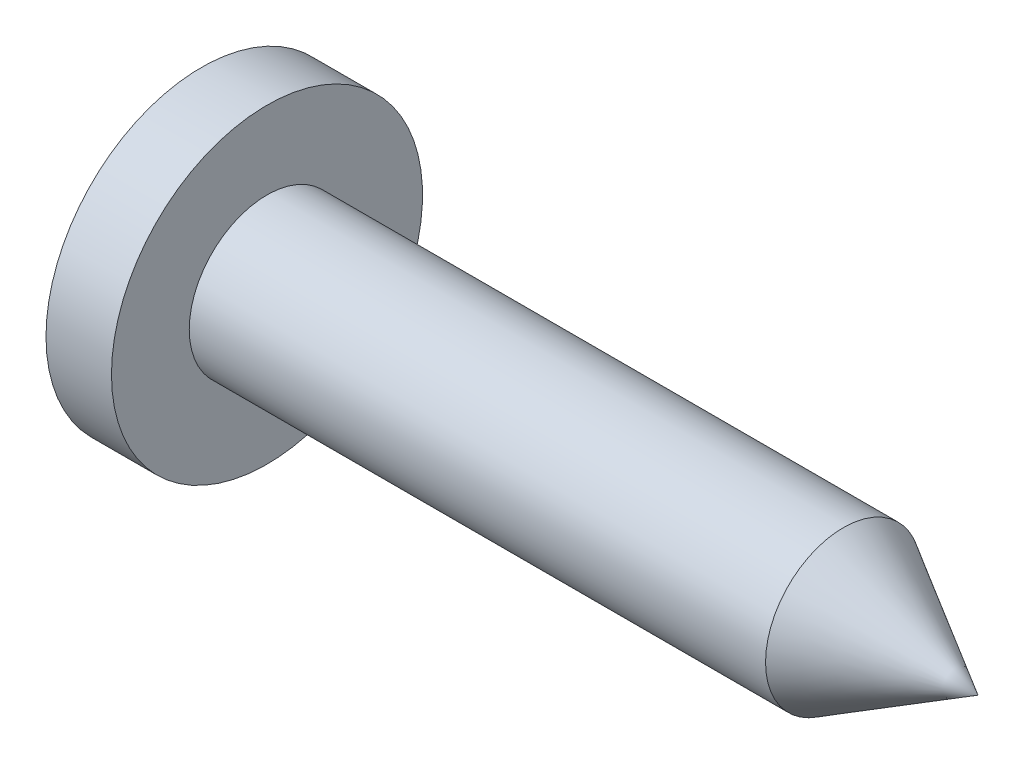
ISO-10303-21;
HEADER;
FILE_DESCRIPTION(('STEP AP214'),'2;1');
FILE_NAME('part.step','',(''),(''),'','','');
FILE_SCHEMA(('AUTOMOTIVE_DESIGN { 1 0 10303 214 1 1 1 1 }'));
ENDSEC;
DATA;
#1=APPLICATION_CONTEXT('core data for automotive mechanical design processes');
#2=APPLICATION_PROTOCOL_DEFINITION('international standard','automotive_design',2000,#1);
#3=PRODUCT_CONTEXT('',#1,'mechanical');
#4=PRODUCT('Part','Part','',(#3));
#5=PRODUCT_RELATED_PRODUCT_CATEGORY('part','',(#4));
#6=PRODUCT_DEFINITION_FORMATION('','',#4);
#7=PRODUCT_DEFINITION_CONTEXT('part definition',#1,'design');
#8=PRODUCT_DEFINITION('design','',#6,#7);
#9=PRODUCT_DEFINITION_SHAPE('','',#8);
#10=(LENGTH_UNIT() NAMED_UNIT(*) SI_UNIT(.MILLI.,.METRE.));
#11=(NAMED_UNIT(*) PLANE_ANGLE_UNIT() SI_UNIT($,.RADIAN.));
#12=(NAMED_UNIT(*) SI_UNIT($,.STERADIAN.) SOLID_ANGLE_UNIT());
#13=UNCERTAINTY_MEASURE_WITH_UNIT(LENGTH_MEASURE(1.E-05),#10,'distance_accuracy_value','');
#14=(GEOMETRIC_REPRESENTATION_CONTEXT(3) GLOBAL_UNCERTAINTY_ASSIGNED_CONTEXT((#13)) GLOBAL_UNIT_ASSIGNED_CONTEXT((#10,
#11,#12)) REPRESENTATION_CONTEXT('',''));
#15=CARTESIAN_POINT('',(0.,0.,0.));
#16=DIRECTION('',(0.,0.,1.));
#17=DIRECTION('',(1.,0.,0.));
#18=AXIS2_PLACEMENT_3D('',#15,#16,#17);
#19=CARTESIAN_POINT('',(3.4,0.,0.));
#20=DIRECTION('',(-1.,0.,0.));
#21=DIRECTION('',(0.,1.,0.));
#22=AXIS2_PLACEMENT_3D('',#19,#20,#21);
#23=SPHERICAL_SURFACE('',#22,6.);
#24=CARTESIAN_POINT('',(-1.47339717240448,0.,0.));
#25=DIRECTION('',(-1.,0.,0.));
#26=DIRECTION('',(0.,0.,1.));
#27=AXIS2_PLACEMENT_3D('',#24,#25,#26);
#28=CIRCLE('',#27,3.5);
#29=CARTESIAN_POINT('',(-1.47339717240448,0.,3.5));
#30=VERTEX_POINT('',#29);
#31=EDGE_CURVE('E629',#30,#30,#28,.T.);
#32=ORIENTED_EDGE('',*,*,#31,.T.);
#33=EDGE_LOOP('',(#32));
#34=FACE_BOUND('',#33,.T.);
#35=CARTESIAN_POINT('',(3.42159027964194,-0.177897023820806,0.102708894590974));
#36=DIRECTION('',(0.104528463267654,-0.861281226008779,0.497260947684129));
#37=DIRECTION('',(0.,-0.499999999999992,-0.866025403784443));
#38=AXIS2_PLACEMENT_3D('',#35,#36,#37);
#39=CIRCLE('',#38,5.9964437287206);
#40=CARTESIAN_POINT('',(-2.52565227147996,-0.497355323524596,0.799551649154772));
#41=VERTEX_POINT('',#40);
#42=CARTESIAN_POINT('',(-2.52418571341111,-0.4875,0.816313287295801));
#43=VERTEX_POINT('',#42);
#44=EDGE_CURVE('E650',#41,#43,#39,.F.);
#45=ORIENTED_EDGE('',*,*,#44,.F.);
#46=CARTESIAN_POINT('',(3.4,0.204156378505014,0.270924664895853));
#47=DIRECTION('',(0.,0.60181502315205,0.798635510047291));
#48=DIRECTION('',(0.,-0.798635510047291,0.60181502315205));
#49=AXIS2_PLACEMENT_3D('',#46,#47,#48);
#50=CIRCLE('',#49,5.99040232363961);
#51=CARTESIAN_POINT('',(-2.08257181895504,-1.72357277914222,1.72357277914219));
#52=VERTEX_POINT('',#51);
#53=EDGE_CURVE('E508',#41,#52,#50,.T.);
#54=ORIENTED_EDGE('',*,*,#53,.T.);
#55=CARTESIAN_POINT('',(3.4,-0.270924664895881,-0.204156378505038));
#56=DIRECTION('',(0.,0.798635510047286,0.601815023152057));
#57=DIRECTION('',(0.,-0.601815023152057,0.798635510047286));
#58=AXIS2_PLACEMENT_3D('',#55,#56,#57);
#59=CIRCLE('',#58,5.9904023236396);
#60=CARTESIAN_POINT('',(-2.52565227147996,-0.799551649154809,0.497355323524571));
#61=VERTEX_POINT('',#60);
#62=EDGE_CURVE('E506',#61,#52,#59,.T.);
#63=ORIENTED_EDGE('',*,*,#62,.F.);
#64=CARTESIAN_POINT('',(3.42159027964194,-0.102708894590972,0.177897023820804));
#65=DIRECTION('',(0.104528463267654,-0.497260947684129,0.861281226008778));
#66=DIRECTION('',(0.,-0.866025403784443,-0.499999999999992));
#67=AXIS2_PLACEMENT_3D('',#64,#65,#66);
#68=CIRCLE('',#67,5.9964437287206);
#69=CARTESIAN_POINT('',(-2.52418571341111,-0.816313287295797,0.4875));
#70=VERTEX_POINT('',#69);
#71=EDGE_CURVE('E647',#70,#61,#68,.F.);
#72=ORIENTED_EDGE('',*,*,#71,.F.);
#73=CARTESIAN_POINT('',(3.4,0.,0.4875));
#74=DIRECTION('',(0.,0.,-1.));
#75=DIRECTION('',(0.,1.,0.));
#76=AXIS2_PLACEMENT_3D('',#73,#74,#75);
#77=CIRCLE('',#76,5.98016251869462);
#78=CARTESIAN_POINT('',(-2.25330379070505,-1.95,0.4875));
#79=VERTEX_POINT('',#78);
#80=EDGE_CURVE('E504',#79,#70,#77,.T.);
#81=ORIENTED_EDGE('',*,*,#80,.F.);
#82=CARTESIAN_POINT('',(3.4,-1.95,0.));
#83=DIRECTION('',(0.,-1.,0.));
#84=DIRECTION('',(0.,0.,-1.));
#85=AXIS2_PLACEMENT_3D('',#82,#83,#84);
#86=CIRCLE('',#85,5.67428409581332);
#87=CARTESIAN_POINT('',(-2.25330379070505,-1.95,-0.4875));
#88=VERTEX_POINT('',#87);
#89=EDGE_CURVE('E11',#79,#88,#86,.T.);
#90=ORIENTED_EDGE('',*,*,#89,.T.);
#91=CARTESIAN_POINT('',(3.4,0.,-0.4875));
#92=DIRECTION('',(0.,0.,-1.));
#93=DIRECTION('',(0.,1.,0.));
#94=AXIS2_PLACEMENT_3D('',#91,#92,#93);
#95=CIRCLE('',#94,5.98016251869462);
#96=CARTESIAN_POINT('',(-2.52418571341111,-0.816313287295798,-0.4875));
#97=VERTEX_POINT('',#96);
#98=EDGE_CURVE('E501',#88,#97,#95,.T.);
#99=ORIENTED_EDGE('',*,*,#98,.T.);
#100=CARTESIAN_POINT('',(3.42159027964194,-0.102708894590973,-0.177897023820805));
#101=DIRECTION('',(0.104528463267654,-0.497260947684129,-0.861281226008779));
#102=DIRECTION('',(0.,0.866025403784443,-0.499999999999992));
#103=AXIS2_PLACEMENT_3D('',#100,#101,#102);
#104=CIRCLE('',#103,5.9964437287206);
#105=CARTESIAN_POINT('',(-2.52565227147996,-0.7995516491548,-0.497355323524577));
#106=VERTEX_POINT('',#105);
#107=EDGE_CURVE('E644',#106,#97,#104,.F.);
#108=ORIENTED_EDGE('',*,*,#107,.F.);
#109=CARTESIAN_POINT('',(3.4,-0.270924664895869,0.20415637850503));
#110=DIRECTION('',(0.,-0.798635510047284,0.60181502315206));
#111=DIRECTION('',(0.,-0.60181502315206,-0.798635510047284));
#112=AXIS2_PLACEMENT_3D('',#109,#110,#111);
#113=CIRCLE('',#112,5.9904023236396);
#114=CARTESIAN_POINT('',(-2.08257181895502,-1.72357277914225,-1.72357277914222));
#115=VERTEX_POINT('',#114);
#116=EDGE_CURVE('E498',#106,#115,#113,.T.);
#117=ORIENTED_EDGE('',*,*,#116,.T.);
#118=CARTESIAN_POINT('',(3.4,0.204156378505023,-0.270924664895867));
#119=DIRECTION('',(0.,0.60181502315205,-0.798635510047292));
#120=DIRECTION('',(0.,0.798635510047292,0.60181502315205));
#121=AXIS2_PLACEMENT_3D('',#118,#119,#120);
#122=CIRCLE('',#121,5.99040232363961);
#123=CARTESIAN_POINT('',(-2.52565227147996,-0.497355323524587,-0.799551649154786));
#124=VERTEX_POINT('',#123);
#125=EDGE_CURVE('E495',#115,#124,#122,.T.);
#126=ORIENTED_EDGE('',*,*,#125,.T.);
#127=CARTESIAN_POINT('',(3.42159027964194,-0.177897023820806,-0.102708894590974));
#128=DIRECTION('',(0.104528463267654,-0.861281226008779,-0.497260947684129));
#129=DIRECTION('',(0.,0.499999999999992,-0.866025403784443));
#130=AXIS2_PLACEMENT_3D('',#127,#128,#129);
#131=CIRCLE('',#130,5.9964437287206);
#132=CARTESIAN_POINT('',(-2.52418571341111,-0.4875,-0.816313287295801));
#133=VERTEX_POINT('',#132);
#134=EDGE_CURVE('E641',#133,#124,#131,.F.);
#135=ORIENTED_EDGE('',*,*,#134,.F.);
#136=CARTESIAN_POINT('',(3.4,-0.4875,0.));
#137=DIRECTION('',(0.,-1.,0.));
#138=DIRECTION('',(0.,0.,-1.));
#139=AXIS2_PLACEMENT_3D('',#136,#137,#138);
#140=CIRCLE('',#139,5.98016251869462);
#141=CARTESIAN_POINT('',(-2.25330379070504,-0.4875,-1.95));
#142=VERTEX_POINT('',#141);
#143=EDGE_CURVE('E492',#133,#142,#140,.T.);
#144=ORIENTED_EDGE('',*,*,#143,.T.);
#145=CARTESIAN_POINT('',(3.4,0.,-1.95));
#146=DIRECTION('',(0.,0.,-1.));
#147=DIRECTION('',(0.,1.,0.));
#148=AXIS2_PLACEMENT_3D('',#145,#146,#147);
#149=CIRCLE('',#148,5.67428409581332);
#150=CARTESIAN_POINT('',(-2.25330379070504,0.4875,-1.95));
#151=VERTEX_POINT('',#150);
#152=EDGE_CURVE('E24',#142,#151,#149,.T.);
#153=ORIENTED_EDGE('',*,*,#152,.T.);
#154=CARTESIAN_POINT('',(3.4,0.4875,0.));
#155=DIRECTION('',(0.,-1.,0.));
#156=DIRECTION('',(0.,0.,-1.));
#157=AXIS2_PLACEMENT_3D('',#154,#155,#156);
#158=CIRCLE('',#157,5.98016251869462);
#159=CARTESIAN_POINT('',(-2.52418571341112,0.4875,-0.816313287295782));
#160=VERTEX_POINT('',#159);
#161=EDGE_CURVE('E490',#160,#151,#158,.T.);
#162=ORIENTED_EDGE('',*,*,#161,.F.);
#163=CARTESIAN_POINT('',(3.42159027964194,0.177897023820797,-0.102708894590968));
#164=DIRECTION('',(0.104528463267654,0.861281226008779,-0.497260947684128));
#165=DIRECTION('',(0.,0.499999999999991,0.866025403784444));
#166=AXIS2_PLACEMENT_3D('',#163,#164,#165);
#167=CIRCLE('',#166,5.9964437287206);
#168=CARTESIAN_POINT('',(-2.52565227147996,0.497355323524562,-0.799551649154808));
#169=VERTEX_POINT('',#168);
#170=EDGE_CURVE('E638',#169,#160,#167,.F.);
#171=ORIENTED_EDGE('',*,*,#170,.F.);
#172=CARTESIAN_POINT('',(3.4,-0.20415637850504,-0.270924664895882));
#173=DIRECTION('',(0.,-0.60181502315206,-0.798635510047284));
#174=DIRECTION('',(0.,0.798635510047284,-0.60181502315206));
#175=AXIS2_PLACEMENT_3D('',#172,#173,#174);
#176=CIRCLE('',#175,5.9904023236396);
#177=CARTESIAN_POINT('',(-2.08257181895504,1.72357277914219,-1.72357277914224));
#178=VERTEX_POINT('',#177);
#179=EDGE_CURVE('E487',#169,#178,#176,.T.);
#180=ORIENTED_EDGE('',*,*,#179,.T.);
#181=CARTESIAN_POINT('',(3.4,0.270924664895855,0.204156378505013));
#182=DIRECTION('',(0.,-0.798635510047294,-0.601815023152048));
#183=DIRECTION('',(0.,0.601815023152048,-0.798635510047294));
#184=AXIS2_PLACEMENT_3D('',#181,#182,#183);
#185=CIRCLE('',#184,5.99040232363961);
#186=CARTESIAN_POINT('',(-2.52565227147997,0.799551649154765,-0.49735532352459));
#187=VERTEX_POINT('',#186);
#188=EDGE_CURVE('E485',#187,#178,#185,.T.);
#189=ORIENTED_EDGE('',*,*,#188,.F.);
#190=CARTESIAN_POINT('',(3.42159027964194,0.102708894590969,-0.177897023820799));
#191=DIRECTION('',(0.104528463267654,0.497260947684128,-0.861281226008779));
#192=DIRECTION('',(0.,0.866025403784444,0.499999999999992));
#193=AXIS2_PLACEMENT_3D('',#190,#191,#192);
#194=CIRCLE('',#193,5.9964437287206);
#195=CARTESIAN_POINT('',(-2.52418571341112,0.816313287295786,-0.4875));
#196=VERTEX_POINT('',#195);
#197=EDGE_CURVE('E635',#196,#187,#194,.F.);
#198=ORIENTED_EDGE('',*,*,#197,.F.);
#199=CARTESIAN_POINT('',(3.4,0.,-0.4875));
#200=DIRECTION('',(0.,0.,-1.));
#201=DIRECTION('',(0.,1.,0.));
#202=AXIS2_PLACEMENT_3D('',#199,#200,#201);
#203=CIRCLE('',#202,5.98016251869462);
#204=CARTESIAN_POINT('',(-2.25330379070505,1.95,-0.4875));
#205=VERTEX_POINT('',#204);
#206=EDGE_CURVE('E39',#196,#205,#203,.T.);
#207=ORIENTED_EDGE('',*,*,#206,.T.);
#208=CARTESIAN_POINT('',(3.4,1.95,0.));
#209=DIRECTION('',(0.,-1.,0.));
#210=DIRECTION('',(0.,0.,-1.));
#211=AXIS2_PLACEMENT_3D('',#208,#209,#210);
#212=CIRCLE('',#211,5.67428409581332);
#213=CARTESIAN_POINT('',(-2.25330379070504,1.95,0.4875));
#214=VERTEX_POINT('',#213);
#215=EDGE_CURVE('E702',#214,#205,#212,.T.);
#216=ORIENTED_EDGE('',*,*,#215,.F.);
#217=CARTESIAN_POINT('',(3.4,0.,0.4875));
#218=DIRECTION('',(0.,0.,-1.));
#219=DIRECTION('',(0.,1.,0.));
#220=AXIS2_PLACEMENT_3D('',#217,#218,#219);
#221=CIRCLE('',#220,5.98016251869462);
#222=CARTESIAN_POINT('',(-2.52418571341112,0.816313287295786,0.4875));
#223=VERTEX_POINT('',#222);
#224=EDGE_CURVE('E520',#223,#214,#221,.T.);
#225=ORIENTED_EDGE('',*,*,#224,.F.);
#226=CARTESIAN_POINT('',(3.42159027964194,0.10270889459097,0.177897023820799));
#227=DIRECTION('',(0.104528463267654,0.497260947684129,0.861281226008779));
#228=DIRECTION('',(0.,-0.866025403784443,0.499999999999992));
#229=AXIS2_PLACEMENT_3D('',#226,#227,#228);
#230=CIRCLE('',#229,5.9964437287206);
#231=CARTESIAN_POINT('',(-2.52565227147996,0.799551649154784,0.497355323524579));
#232=VERTEX_POINT('',#231);
#233=EDGE_CURVE('E656',#232,#223,#230,.F.);
#234=ORIENTED_EDGE('',*,*,#233,.F.);
#235=CARTESIAN_POINT('',(3.4,0.27092466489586,-0.204156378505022));
#236=DIRECTION('',(0.,-0.798635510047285,0.601815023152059));
#237=DIRECTION('',(0.,-0.601815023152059,-0.798635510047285));
#238=AXIS2_PLACEMENT_3D('',#235,#236,#237);
#239=CIRCLE('',#238,5.99040232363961);
#240=CARTESIAN_POINT('',(-2.08257181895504,1.72357277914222,1.72357277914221));
#241=VERTEX_POINT('',#240);
#242=EDGE_CURVE('E518',#241,#232,#239,.T.);
#243=ORIENTED_EDGE('',*,*,#242,.F.);
#244=CARTESIAN_POINT('',(3.4,-0.204156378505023,0.270924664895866));
#245=DIRECTION('',(0.,0.601815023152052,-0.79863551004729));
#246=DIRECTION('',(0.,0.798635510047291,0.601815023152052));
#247=AXIS2_PLACEMENT_3D('',#244,#245,#246);
#248=CIRCLE('',#247,5.99040232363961);
#249=CARTESIAN_POINT('',(-2.52565227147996,0.497355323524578,0.799551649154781));
#250=VERTEX_POINT('',#249);
#251=EDGE_CURVE('E516',#250,#241,#248,.T.);
#252=ORIENTED_EDGE('',*,*,#251,.F.);
#253=CARTESIAN_POINT('',(3.42159027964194,0.177897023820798,0.102708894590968));
#254=DIRECTION('',(0.104528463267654,0.861281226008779,0.497260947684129));
#255=DIRECTION('',(0.,-0.499999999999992,0.866025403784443));
#256=AXIS2_PLACEMENT_3D('',#253,#254,#255);
#257=CIRCLE('',#256,5.9964437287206);
#258=CARTESIAN_POINT('',(-2.52418571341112,0.4875,0.816313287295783));
#259=VERTEX_POINT('',#258);
#260=EDGE_CURVE('E653',#259,#250,#257,.F.);
#261=ORIENTED_EDGE('',*,*,#260,.F.);
#262=CARTESIAN_POINT('',(3.4,0.4875,0.));
#263=DIRECTION('',(0.,-1.,0.));
#264=DIRECTION('',(0.,0.,-1.));
#265=AXIS2_PLACEMENT_3D('',#262,#263,#264);
#266=CIRCLE('',#265,5.98016251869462);
#267=CARTESIAN_POINT('',(-2.25330379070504,0.4875,1.95));
#268=VERTEX_POINT('',#267);
#269=EDGE_CURVE('E514',#268,#259,#266,.T.);
#270=ORIENTED_EDGE('',*,*,#269,.F.);
#271=CARTESIAN_POINT('',(3.4,0.,1.95));
#272=DIRECTION('',(0.,0.,-1.));
#273=DIRECTION('',(0.,1.,0.));
#274=AXIS2_PLACEMENT_3D('',#271,#272,#273);
#275=CIRCLE('',#274,5.67428409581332);
#276=CARTESIAN_POINT('',(-2.25330379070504,-0.4875,1.95));
#277=VERTEX_POINT('',#276);
#278=EDGE_CURVE('E700',#277,#268,#275,.T.);
#279=ORIENTED_EDGE('',*,*,#278,.F.);
#280=CARTESIAN_POINT('',(3.4,-0.4875,0.));
#281=DIRECTION('',(0.,-1.,0.));
#282=DIRECTION('',(0.,0.,-1.));
#283=AXIS2_PLACEMENT_3D('',#280,#281,#282);
#284=CIRCLE('',#283,5.98016251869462);
#285=EDGE_CURVE('E511',#277,#43,#284,.T.);
#286=ORIENTED_EDGE('',*,*,#285,.T.);
#287=EDGE_LOOP('',(#45,#54,#63,#72,#81,#90,#99,#108,#117,#126,#135,#144,#153,#162,#171,#180,
#189,#198,#207,#216,#225,#234,#243,#252,#261,#270,#279,#286));
#288=FACE_BOUND('',#287,.T.);
#289=ADVANCED_FACE('F16',(#34,#288),#23,.T.);
#290=CARTESIAN_POINT('',(-2.6,1.17,0.2925));
#291=DIRECTION('',(0.104528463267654,0.497260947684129,0.861281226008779));
#292=DIRECTION('',(0.,-0.866025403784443,0.499999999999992));
#293=AXIS2_PLACEMENT_3D('',#290,#291,#292);
#294=PLANE('',#293);
#295=ORIENTED_EDGE('',*,*,#233,.T.);
#296=DIRECTION('',(-0.978612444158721,0.205712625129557,0.));
#297=VECTOR('',#296,1.);
#298=CARTESIAN_POINT('',(-2.66799342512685,0.846542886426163,0.4875));
#299=LINE('',#298,#297);
#300=CARTESIAN_POINT('',(-2.40911824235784,0.792125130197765,0.4875));
#301=VERTEX_POINT('',#300);
#302=EDGE_CURVE('E697',#223,#301,#299,.F.);
#303=ORIENTED_EDGE('',*,*,#302,.T.);
#304=DIRECTION('',(0.994439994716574,-0.0633739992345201,-0.0841001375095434));
#305=VECTOR('',#304,1.);
#306=CARTESIAN_POINT('',(-2.60538924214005,0.804633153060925,0.504098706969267));
#307=LINE('',#306,#305);
#308=EDGE_CURVE('E694',#301,#232,#307,.F.);
#309=ORIENTED_EDGE('',*,*,#308,.T.);
#310=EDGE_LOOP('',(#295,#303,#309));
#311=FACE_BOUND('',#310,.T.);
#312=ADVANCED_FACE('F782',(#311),#294,.F.);
#313=CARTESIAN_POINT('',(-2.6,0.292499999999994,1.17));
#314=DIRECTION('',(0.104528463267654,0.861281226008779,0.497260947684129));
#315=DIRECTION('',(0.,-0.499999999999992,0.866025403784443));
#316=AXIS2_PLACEMENT_3D('',#313,#314,#315);
#317=PLANE('',#316);
#318=ORIENTED_EDGE('',*,*,#260,.T.);
#319=DIRECTION('',(-0.994439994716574,0.0841001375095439,0.0633739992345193));
#320=VECTOR('',#319,1.);
#321=CARTESIAN_POINT('',(-2.60538924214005,0.504098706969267,0.804633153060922));
#322=LINE('',#321,#320);
#323=CARTESIAN_POINT('',(-2.40911824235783,0.4875,0.79212513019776));
#324=VERTEX_POINT('',#323);
#325=EDGE_CURVE('E691',#250,#324,#322,.F.);
#326=ORIENTED_EDGE('',*,*,#325,.T.);
#327=DIRECTION('',(0.978612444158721,0.,-0.205712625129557));
#328=VECTOR('',#327,1.);
#329=CARTESIAN_POINT('',(-2.66799342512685,0.4875,0.846542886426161));
#330=LINE('',#329,#328);
#331=EDGE_CURVE('E688',#324,#259,#330,.F.);
#332=ORIENTED_EDGE('',*,*,#331,.T.);
#333=EDGE_LOOP('',(#318,#326,#332));
#334=FACE_BOUND('',#333,.T.);
#335=ADVANCED_FACE('F762',(#334),#317,.F.);
#336=CARTESIAN_POINT('',(-2.6,-0.292500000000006,1.17));
#337=DIRECTION('',(0.104528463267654,-0.861281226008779,0.497260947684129));
#338=DIRECTION('',(0.,-0.499999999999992,-0.866025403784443));
#339=AXIS2_PLACEMENT_3D('',#336,#337,#338);
#340=PLANE('',#339);
#341=DIRECTION('',(0.978612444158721,0.,-0.205712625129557));
#342=VECTOR('',#341,1.);
#343=CARTESIAN_POINT('',(-2.66799342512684,-0.4875,0.846542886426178));
#344=LINE('',#343,#342);
#345=CARTESIAN_POINT('',(-2.40911824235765,-0.4875,0.79212513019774));
#346=VERTEX_POINT('',#345);
#347=EDGE_CURVE('E686',#346,#43,#344,.F.);
#348=ORIENTED_EDGE('',*,*,#347,.F.);
#349=DIRECTION('',(-0.994439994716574,-0.0841001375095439,0.0633739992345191));
#350=VECTOR('',#349,1.);
#351=CARTESIAN_POINT('',(-2.60538924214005,-0.504098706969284,0.804633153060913));
#352=LINE('',#351,#350);
#353=EDGE_CURVE('E332',#41,#346,#352,.F.);
#354=ORIENTED_EDGE('',*,*,#353,.F.);
#355=ORIENTED_EDGE('',*,*,#44,.T.);
#356=EDGE_LOOP('',(#348,#354,#355));
#357=FACE_BOUND('',#356,.T.);
#358=ADVANCED_FACE('F960',(#357),#340,.F.);
#359=CARTESIAN_POINT('',(-2.6,-1.17000000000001,0.2925));
#360=DIRECTION('',(0.104528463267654,-0.497260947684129,0.861281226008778));
#361=DIRECTION('',(0.,-0.866025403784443,-0.499999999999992));
#362=AXIS2_PLACEMENT_3D('',#359,#360,#361);
#363=PLANE('',#362);
#364=ORIENTED_EDGE('',*,*,#71,.T.);
#365=DIRECTION('',(-0.994439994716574,-0.0633739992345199,0.0841001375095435));
#366=VECTOR('',#365,1.);
#367=CARTESIAN_POINT('',(-2.60538924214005,-0.804633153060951,0.504098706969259));
#368=LINE('',#367,#366);
#369=CARTESIAN_POINT('',(-2.40911824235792,-0.792125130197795,0.4875));
#370=VERTEX_POINT('',#369);
#371=EDGE_CURVE('E682',#61,#370,#368,.F.);
#372=ORIENTED_EDGE('',*,*,#371,.T.);
#373=DIRECTION('',(0.978612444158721,0.205712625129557,0.));
#374=VECTOR('',#373,1.);
#375=CARTESIAN_POINT('',(-2.66799342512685,-0.846542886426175,0.4875));
#376=LINE('',#375,#374);
#377=EDGE_CURVE('E679',#370,#70,#376,.F.);
#378=ORIENTED_EDGE('',*,*,#377,.T.);
#379=EDGE_LOOP('',(#364,#372,#378));
#380=FACE_BOUND('',#379,.T.);
#381=ADVANCED_FACE('F957',(#380),#363,.F.);
#382=CARTESIAN_POINT('',(-2.6,-1.17000000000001,-0.2925));
#383=DIRECTION('',(0.104528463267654,-0.497260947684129,-0.861281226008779));
#384=DIRECTION('',(0.,0.866025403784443,-0.499999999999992));
#385=AXIS2_PLACEMENT_3D('',#382,#383,#384);
#386=PLANE('',#385);
#387=DIRECTION('',(0.978612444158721,0.205712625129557,0.));
#388=VECTOR('',#387,1.);
#389=CARTESIAN_POINT('',(-2.66799342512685,-0.846542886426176,-0.4875));
#390=LINE('',#389,#388);
#391=CARTESIAN_POINT('',(-2.40911824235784,-0.792125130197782,-0.4875));
#392=VERTEX_POINT('',#391);
#393=EDGE_CURVE('E677',#392,#97,#390,.F.);
#394=ORIENTED_EDGE('',*,*,#393,.F.);
#395=DIRECTION('',(-0.994439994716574,-0.0633739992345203,-0.0841001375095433));
#396=VECTOR('',#395,1.);
#397=CARTESIAN_POINT('',(-2.60538924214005,-0.804633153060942,-0.504098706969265));
#398=LINE('',#397,#396);
#399=EDGE_CURVE('E675',#106,#392,#398,.F.);
#400=ORIENTED_EDGE('',*,*,#399,.F.);
#401=ORIENTED_EDGE('',*,*,#107,.T.);
#402=EDGE_LOOP('',(#394,#400,#401));
#403=FACE_BOUND('',#402,.T.);
#404=ADVANCED_FACE('F948',(#403),#386,.F.);
#405=CARTESIAN_POINT('',(-2.6,-0.292500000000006,-1.17));
#406=DIRECTION('',(0.104528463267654,-0.861281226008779,-0.497260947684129));
#407=DIRECTION('',(0.,0.499999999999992,-0.866025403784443));
#408=AXIS2_PLACEMENT_3D('',#405,#406,#407);
#409=PLANE('',#408);
#410=DIRECTION('',(0.994439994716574,0.084100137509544,0.0633739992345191));
#411=VECTOR('',#410,1.);
#412=CARTESIAN_POINT('',(-2.60538924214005,-0.504098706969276,-0.804633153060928));
#413=LINE('',#412,#411);
#414=CARTESIAN_POINT('',(-2.40911824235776,-0.4875,-0.792125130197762));
#415=VERTEX_POINT('',#414);
#416=EDGE_CURVE('E673',#415,#124,#413,.F.);
#417=ORIENTED_EDGE('',*,*,#416,.F.);
#418=DIRECTION('',(-0.978612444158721,0.,-0.205712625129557));
#419=VECTOR('',#418,1.);
#420=CARTESIAN_POINT('',(-2.66799342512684,-0.4875,-0.846542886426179));
#421=LINE('',#420,#419);
#422=EDGE_CURVE('E671',#133,#415,#421,.F.);
#423=ORIENTED_EDGE('',*,*,#422,.F.);
#424=ORIENTED_EDGE('',*,*,#134,.T.);
#425=EDGE_LOOP('',(#417,#423,#424));
#426=FACE_BOUND('',#425,.T.);
#427=ADVANCED_FACE('F827',(#426),#409,.F.);
#428=CARTESIAN_POINT('',(-2.6,0.292499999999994,-1.17));
#429=DIRECTION('',(0.104528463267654,0.861281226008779,-0.497260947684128));
#430=DIRECTION('',(0.,0.499999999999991,0.866025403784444));
#431=AXIS2_PLACEMENT_3D('',#428,#429,#430);
#432=PLANE('',#431);
#433=ORIENTED_EDGE('',*,*,#170,.T.);
#434=DIRECTION('',(-0.978612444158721,0.,-0.205712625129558));
#435=VECTOR('',#434,1.);
#436=CARTESIAN_POINT('',(-2.66799342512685,0.4875,-0.84654288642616));
#437=LINE('',#436,#435);
#438=CARTESIAN_POINT('',(-2.40911824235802,0.4875,-0.7921251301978));
#439=VERTEX_POINT('',#438);
#440=EDGE_CURVE('E668',#160,#439,#437,.F.);
#441=ORIENTED_EDGE('',*,*,#440,.T.);
#442=DIRECTION('',(-0.994439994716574,0.0841001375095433,-0.0633739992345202));
#443=VECTOR('',#442,1.);
#444=CARTESIAN_POINT('',(-2.60538924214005,0.504098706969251,-0.80463315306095));
#445=LINE('',#444,#443);
#446=EDGE_CURVE('E666',#169,#439,#445,.F.);
#447=ORIENTED_EDGE('',*,*,#446,.F.);
#448=EDGE_LOOP('',(#433,#441,#447));
#449=FACE_BOUND('',#448,.T.);
#450=ADVANCED_FACE('F727',(#449),#432,.F.);
#451=CARTESIAN_POINT('',(-2.6,1.17,-0.2925));
#452=DIRECTION('',(0.104528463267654,0.497260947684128,-0.861281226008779));
#453=DIRECTION('',(0.,0.866025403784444,0.499999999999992));
#454=AXIS2_PLACEMENT_3D('',#451,#452,#453);
#455=PLANE('',#454);
#456=ORIENTED_EDGE('',*,*,#197,.T.);
#457=DIRECTION('',(-0.994439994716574,0.0633739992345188,-0.0841001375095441));
#458=VECTOR('',#457,1.);
#459=CARTESIAN_POINT('',(-2.60538924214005,0.804633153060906,-0.504098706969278));
#460=LINE('',#459,#458);
#461=CARTESIAN_POINT('',(-2.40911824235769,0.792125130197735,-0.4875));
#462=VERTEX_POINT('',#461);
#463=EDGE_CURVE('E663',#187,#462,#460,.F.);
#464=ORIENTED_EDGE('',*,*,#463,.T.);
#465=DIRECTION('',(-0.978612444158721,0.205712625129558,0.));
#466=VECTOR('',#465,1.);
#467=CARTESIAN_POINT('',(-2.66799342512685,0.846542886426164,-0.4875));
#468=LINE('',#467,#466);
#469=EDGE_CURVE('E661',#196,#462,#468,.F.);
#470=ORIENTED_EDGE('',*,*,#469,.F.);
#471=EDGE_LOOP('',(#456,#464,#470));
#472=FACE_BOUND('',#471,.T.);
#473=ADVANCED_FACE('F732',(#472),#455,.F.);
#474=CARTESIAN_POINT('',(0.,0.,0.));
#475=DIRECTION('',(-1.,0.,0.));
#476=DIRECTION('',(0.,0.,1.));
#477=AXIS2_PLACEMENT_3D('',#474,#475,#476);
#478=CYLINDRICAL_SURFACE('',#477,1.75);
#479=CARTESIAN_POINT('',(0.,0.,0.));
#480=DIRECTION('',(-1.,0.,0.));
#481=DIRECTION('',(0.,0.,1.));
#482=AXIS2_PLACEMENT_3D('',#479,#480,#481);
#483=CIRCLE('',#482,1.75);
#484=CARTESIAN_POINT('',(0.,0.,1.75));
#485=VERTEX_POINT('',#484);
#486=EDGE_CURVE('E626',#485,#485,#483,.T.);
#487=ORIENTED_EDGE('',*,*,#486,.F.);
#488=EDGE_LOOP('',(#487));
#489=FACE_BOUND('',#488,.T.);
#490=CARTESIAN_POINT('',(12.9689110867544,0.,0.));
#491=DIRECTION('',(-1.,0.,0.));
#492=DIRECTION('',(0.,0.,1.));
#493=AXIS2_PLACEMENT_3D('',#490,#491,#492);
#494=CIRCLE('',#493,1.75);
#495=CARTESIAN_POINT('',(12.9689110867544,0.,1.75));
#496=VERTEX_POINT('',#495);
#497=EDGE_CURVE('E526',#496,#496,#494,.T.);
#498=ORIENTED_EDGE('',*,*,#497,.T.);
#499=EDGE_LOOP('',(#498));
#500=FACE_BOUND('',#499,.T.);
#501=ADVANCED_FACE('F793',(#489,#500),#478,.T.);
#502=CARTESIAN_POINT('',(0.,1.75,0.));
#503=DIRECTION('',(-1.,0.,0.));
#504=DIRECTION('',(0.,0.,1.));
#505=AXIS2_PLACEMENT_3D('',#502,#503,#504);
#506=PLANE('',#505);
#507=CARTESIAN_POINT('',(0.,0.,0.));
#508=DIRECTION('',(-1.,0.,0.));
#509=DIRECTION('',(0.,0.,1.));
#510=AXIS2_PLACEMENT_3D('',#507,#508,#509);
#511=CIRCLE('',#510,3.5);
#512=CARTESIAN_POINT('',(0.,0.,3.5));
#513=VERTEX_POINT('',#512);
#514=EDGE_CURVE('E632',#513,#513,#511,.T.);
#515=ORIENTED_EDGE('',*,*,#514,.F.);
#516=EDGE_LOOP('',(#515));
#517=FACE_BOUND('',#516,.T.);
#518=ORIENTED_EDGE('',*,*,#486,.T.);
#519=EDGE_LOOP('',(#518));
#520=FACE_BOUND('',#519,.T.);
#521=ADVANCED_FACE('F18',(#517,#520),#506,.F.);
#522=CARTESIAN_POINT('',(0.,0.,0.));
#523=DIRECTION('',(-1.,0.,0.));
#524=DIRECTION('',(0.,0.,1.));
#525=AXIS2_PLACEMENT_3D('',#522,#523,#524);
#526=CYLINDRICAL_SURFACE('',#525,3.5);
#527=ORIENTED_EDGE('',*,*,#31,.F.);
#528=EDGE_LOOP('',(#527));
#529=FACE_BOUND('',#528,.T.);
#530=ORIENTED_EDGE('',*,*,#514,.T.);
#531=EDGE_LOOP('',(#530));
#532=FACE_BOUND('',#531,.T.);
#533=ADVANCED_FACE('F795',(#529,#532),#526,.T.);
#534=CARTESIAN_POINT('',(12.9689110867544,0.,0.));
#535=DIRECTION('',(-1.,0.,0.));
#536=DIRECTION('',(0.,0.,1.));
#537=AXIS2_PLACEMENT_3D('',#534,#535,#536);
#538=CONICAL_SURFACE('',#537,1.75,0.523598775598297);
#539=CARTESIAN_POINT('',(16.,0.,0.));
#540=VERTEX_POINT('',#539);
#541=VERTEX_LOOP('',#540);
#542=FACE_BOUND('',#541,.T.);
#543=ORIENTED_EDGE('',*,*,#497,.F.);
#544=EDGE_LOOP('',(#543));
#545=FACE_BOUND('',#544,.T.);
#546=ADVANCED_FACE('F797',(#542,#545),#538,.T.);
#547=CARTESIAN_POINT('',(-1.3,-1.95,-4.13378680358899));
#548=DIRECTION('',(0.,-1.,0.));
#549=DIRECTION('',(0.,0.,-1.));
#550=AXIS2_PLACEMENT_3D('',#547,#548,#549);
#551=PLANE('',#550);
#552=DIRECTION('',(-1.,0.,0.));
#553=VECTOR('',#552,1.);
#554=CARTESIAN_POINT('',(-1.3,-1.95,0.4875));
#555=LINE('',#554,#553);
#556=CARTESIAN_POINT('',(-1.3,-1.95,0.4875));
#557=VERTEX_POINT('',#556);
#558=EDGE_CURVE('E440',#557,#79,#555,.T.);
#559=ORIENTED_EDGE('',*,*,#558,.F.);
#560=DIRECTION('',(0.,0.,1.));
#561=VECTOR('',#560,1.);
#562=CARTESIAN_POINT('',(-1.3,-1.95,-4.13378680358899));
#563=LINE('',#562,#561);
#564=CARTESIAN_POINT('',(-1.3,-1.95,-0.4875));
#565=VERTEX_POINT('',#564);
#566=EDGE_CURVE('E355',#565,#557,#563,.T.);
#567=ORIENTED_EDGE('',*,*,#566,.F.);
#568=DIRECTION('',(-1.,0.,0.));
#569=VECTOR('',#568,1.);
#570=CARTESIAN_POINT('',(-1.3,-1.95,-0.4875));
#571=LINE('',#570,#569);
#572=EDGE_CURVE('E437',#565,#88,#571,.T.);
#573=ORIENTED_EDGE('',*,*,#572,.T.);
#574=ORIENTED_EDGE('',*,*,#89,.F.);
#575=EDGE_LOOP('',(#559,#567,#573,#574));
#576=FACE_BOUND('',#575,.T.);
#577=ADVANCED_FACE('F804',(#576),#551,.F.);
#578=CARTESIAN_POINT('',(-1.3,0.0298034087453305,-1.95));
#579=DIRECTION('',(0.,0.,-1.));
#580=DIRECTION('',(0.,1.,0.));
#581=AXIS2_PLACEMENT_3D('',#578,#579,#580);
#582=PLANE('',#581);
#583=DIRECTION('',(-1.,0.,0.));
#584=VECTOR('',#583,1.);
#585=CARTESIAN_POINT('',(-1.3,-0.4875,-1.95));
#586=LINE('',#585,#584);
#587=CARTESIAN_POINT('',(-1.3,-0.4875,-1.95));
#588=VERTEX_POINT('',#587);
#589=EDGE_CURVE('E425',#588,#142,#586,.T.);
#590=ORIENTED_EDGE('',*,*,#589,.F.);
#591=DIRECTION('',(0.,-1.,0.));
#592=VECTOR('',#591,1.);
#593=CARTESIAN_POINT('',(-1.3,0.0298034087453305,-1.95));
#594=LINE('',#593,#592);
#595=CARTESIAN_POINT('',(-1.3,0.4875,-1.95));
#596=VERTEX_POINT('',#595);
#597=EDGE_CURVE('E370',#596,#588,#594,.T.);
#598=ORIENTED_EDGE('',*,*,#597,.F.);
#599=DIRECTION('',(-1.,0.,0.));
#600=VECTOR('',#599,1.);
#601=CARTESIAN_POINT('',(-1.3,0.4875,-1.95));
#602=LINE('',#601,#600);
#603=EDGE_CURVE('E422',#596,#151,#602,.T.);
#604=ORIENTED_EDGE('',*,*,#603,.T.);
#605=ORIENTED_EDGE('',*,*,#152,.F.);
#606=EDGE_LOOP('',(#590,#598,#604,#605));
#607=FACE_BOUND('',#606,.T.);
#608=ADVANCED_FACE('F710',(#607),#582,.F.);
#609=CARTESIAN_POINT('',(-1.3,1.95,-4.13378680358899));
#610=DIRECTION('',(0.,-1.,0.));
#611=DIRECTION('',(0.,0.,-1.));
#612=AXIS2_PLACEMENT_3D('',#609,#610,#611);
#613=PLANE('',#612);
#614=ORIENTED_EDGE('',*,*,#215,.T.);
#615=DIRECTION('',(-1.,0.,0.));
#616=VECTOR('',#615,1.);
#617=CARTESIAN_POINT('',(-1.3,1.95,-0.4875));
#618=LINE('',#617,#616);
#619=CARTESIAN_POINT('',(-1.3,1.95,-0.4875));
#620=VERTEX_POINT('',#619);
#621=EDGE_CURVE('E411',#620,#205,#618,.T.);
#622=ORIENTED_EDGE('',*,*,#621,.F.);
#623=DIRECTION('',(0.,0.,1.));
#624=VECTOR('',#623,1.);
#625=CARTESIAN_POINT('',(-1.3,1.95,-4.13378680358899));
#626=LINE('',#625,#624);
#627=CARTESIAN_POINT('',(-1.3,1.95,0.4875));
#628=VERTEX_POINT('',#627);
#629=EDGE_CURVE('E383',#620,#628,#626,.T.);
#630=ORIENTED_EDGE('',*,*,#629,.T.);
#631=DIRECTION('',(-1.,0.,0.));
#632=VECTOR('',#631,1.);
#633=CARTESIAN_POINT('',(-1.3,1.95,0.4875));
#634=LINE('',#633,#632);
#635=EDGE_CURVE('E408',#628,#214,#634,.T.);
#636=ORIENTED_EDGE('',*,*,#635,.T.);
#637=EDGE_LOOP('',(#614,#622,#630,#636));
#638=FACE_BOUND('',#637,.T.);
#639=ADVANCED_FACE('F743',(#638),#613,.T.);
#640=CARTESIAN_POINT('',(-1.3,0.0298034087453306,1.95));
#641=DIRECTION('',(0.,0.,-1.));
#642=DIRECTION('',(0.,1.,0.));
#643=AXIS2_PLACEMENT_3D('',#640,#641,#642);
#644=PLANE('',#643);
#645=ORIENTED_EDGE('',*,*,#278,.T.);
#646=DIRECTION('',(-1.,0.,0.));
#647=VECTOR('',#646,1.);
#648=CARTESIAN_POINT('',(-1.3,0.4875,1.95));
#649=LINE('',#648,#647);
#650=CARTESIAN_POINT('',(-1.3,0.4875,1.95));
#651=VERTEX_POINT('',#650);
#652=EDGE_CURVE('E396',#651,#268,#649,.T.);
#653=ORIENTED_EDGE('',*,*,#652,.F.);
#654=DIRECTION('',(0.,-1.,0.));
#655=VECTOR('',#654,1.);
#656=CARTESIAN_POINT('',(-1.3,0.0298034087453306,1.95));
#657=LINE('',#656,#655);
#658=CARTESIAN_POINT('',(-1.3,-0.4875,1.95));
#659=VERTEX_POINT('',#658);
#660=EDGE_CURVE('E393',#651,#659,#657,.T.);
#661=ORIENTED_EDGE('',*,*,#660,.T.);
#662=DIRECTION('',(-1.,0.,0.));
#663=VECTOR('',#662,1.);
#664=CARTESIAN_POINT('',(-1.3,-0.4875,1.95));
#665=LINE('',#664,#663);
#666=EDGE_CURVE('E342',#659,#277,#665,.T.);
#667=ORIENTED_EDGE('',*,*,#666,.T.);
#668=EDGE_LOOP('',(#645,#653,#661,#667));
#669=FACE_BOUND('',#668,.T.);
#670=ADVANCED_FACE('F768',(#669),#644,.T.);
#671=CARTESIAN_POINT('',(-1.3,0.0298034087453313,0.4875));
#672=DIRECTION('',(0.,0.,-1.));
#673=DIRECTION('',(0.,1.,0.));
#674=AXIS2_PLACEMENT_3D('',#671,#672,#673);
#675=PLANE('',#674);
#676=ORIENTED_EDGE('',*,*,#224,.T.);
#677=ORIENTED_EDGE('',*,*,#635,.F.);
#678=DIRECTION('',(0.,-1.,0.));
#679=VECTOR('',#678,1.);
#680=CARTESIAN_POINT('',(-1.3,0.0298034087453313,0.4875));
#681=LINE('',#680,#679);
#682=CARTESIAN_POINT('',(-1.3,0.792125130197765,0.4875));
#683=VERTEX_POINT('',#682);
#684=EDGE_CURVE('E385',#628,#683,#681,.T.);
#685=ORIENTED_EDGE('',*,*,#684,.T.);
#686=DIRECTION('',(-1.,0.,0.));
#687=VECTOR('',#686,1.);
#688=CARTESIAN_POINT('',(-1.3,0.792125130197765,0.4875));
#689=LINE('',#688,#687);
#690=EDGE_CURVE('E405',#683,#301,#689,.T.);
#691=ORIENTED_EDGE('',*,*,#690,.T.);
#692=ORIENTED_EDGE('',*,*,#302,.F.);
#693=EDGE_LOOP('',(#676,#677,#685,#691,#692));
#694=FACE_BOUND('',#693,.T.);
#695=ADVANCED_FACE('F746',(#694),#675,.T.);
#696=CARTESIAN_POINT('',(-1.3,-1.70510655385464,-2.82643837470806));
#697=DIRECTION('',(0.,-0.798635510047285,0.601815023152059));
#698=DIRECTION('',(0.,-0.601815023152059,-0.798635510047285));
#699=AXIS2_PLACEMENT_3D('',#696,#697,#698);
#700=PLANE('',#699);
#701=ORIENTED_EDGE('',*,*,#242,.T.);
#702=ORIENTED_EDGE('',*,*,#308,.F.);
#703=ORIENTED_EDGE('',*,*,#690,.F.);
#704=DIRECTION('',(0.,0.601815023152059,0.798635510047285));
#705=VECTOR('',#704,1.);
#706=CARTESIAN_POINT('',(-1.3,-1.70510655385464,-2.82643837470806));
#707=LINE('',#706,#705);
#708=CARTESIAN_POINT('',(-1.3,1.72357277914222,1.72357277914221));
#709=VERTEX_POINT('',#708);
#710=EDGE_CURVE('E387',#683,#709,#707,.T.);
#711=ORIENTED_EDGE('',*,*,#710,.T.);
#712=DIRECTION('',(-1.,0.,0.));
#713=VECTOR('',#712,1.);
#714=CARTESIAN_POINT('',(-1.3,1.72357277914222,1.72357277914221));
#715=LINE('',#714,#713);
#716=EDGE_CURVE('E402',#709,#241,#715,.T.);
#717=ORIENTED_EDGE('',*,*,#716,.T.);
#718=EDGE_LOOP('',(#701,#702,#703,#711,#717));
#719=FACE_BOUND('',#718,.T.);
#720=ADVANCED_FACE('F753',(#719),#700,.T.);
#721=CARTESIAN_POINT('',(-1.3,-2.17197266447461,-1.21193126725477));
#722=DIRECTION('',(0.,0.601815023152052,-0.79863551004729));
#723=DIRECTION('',(0.,0.798635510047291,0.601815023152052));
#724=AXIS2_PLACEMENT_3D('',#721,#722,#723);
#725=PLANE('',#724);
#726=ORIENTED_EDGE('',*,*,#251,.T.);
#727=ORIENTED_EDGE('',*,*,#716,.F.);
#728=DIRECTION('',(0.,-0.79863551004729,-0.601815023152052));
#729=VECTOR('',#728,1.);
#730=CARTESIAN_POINT('',(-1.3,-2.17197266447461,-1.21193126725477));
#731=LINE('',#730,#729);
#732=CARTESIAN_POINT('',(-1.3,0.4875,0.792125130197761));
#733=VERTEX_POINT('',#732);
#734=EDGE_CURVE('E389',#709,#733,#731,.T.);
#735=ORIENTED_EDGE('',*,*,#734,.T.);
#736=DIRECTION('',(-1.,0.,0.));
#737=VECTOR('',#736,1.);
#738=CARTESIAN_POINT('',(-1.3,0.4875,0.792125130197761));
#739=LINE('',#738,#737);
#740=EDGE_CURVE('E399',#733,#324,#739,.T.);
#741=ORIENTED_EDGE('',*,*,#740,.T.);
#742=ORIENTED_EDGE('',*,*,#325,.F.);
#743=EDGE_LOOP('',(#726,#727,#735,#741,#742));
#744=FACE_BOUND('',#743,.T.);
#745=ADVANCED_FACE('F756',(#744),#725,.T.);
#746=CARTESIAN_POINT('',(-1.3,0.4875,-4.13378680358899));
#747=DIRECTION('',(0.,-1.,0.));
#748=DIRECTION('',(0.,0.,-1.));
#749=AXIS2_PLACEMENT_3D('',#746,#747,#748);
#750=PLANE('',#749);
#751=ORIENTED_EDGE('',*,*,#269,.T.);
#752=ORIENTED_EDGE('',*,*,#331,.F.);
#753=ORIENTED_EDGE('',*,*,#740,.F.);
#754=DIRECTION('',(0.,0.,1.));
#755=VECTOR('',#754,1.);
#756=CARTESIAN_POINT('',(-1.3,0.4875,-4.13378680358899));
#757=LINE('',#756,#755);
#758=EDGE_CURVE('E391',#733,#651,#757,.T.);
#759=ORIENTED_EDGE('',*,*,#758,.T.);
#760=ORIENTED_EDGE('',*,*,#652,.T.);
#761=EDGE_LOOP('',(#751,#752,#753,#759,#760));
#762=FACE_BOUND('',#761,.T.);
#763=ADVANCED_FACE('F764',(#762),#750,.T.);
#764=CARTESIAN_POINT('',(-1.3,-0.4875,-4.13378680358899));
#765=DIRECTION('',(0.,-1.,0.));
#766=DIRECTION('',(0.,0.,-1.));
#767=AXIS2_PLACEMENT_3D('',#764,#765,#766);
#768=PLANE('',#767);
#769=ORIENTED_EDGE('',*,*,#666,.F.);
#770=DIRECTION('',(0.,0.,1.));
#771=VECTOR('',#770,1.);
#772=CARTESIAN_POINT('',(-1.3,-0.4875,-4.13378680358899));
#773=LINE('',#772,#771);
#774=CARTESIAN_POINT('',(-1.3,-0.4875,0.792125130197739));
#775=VERTEX_POINT('',#774);
#776=EDGE_CURVE('E339',#775,#659,#773,.T.);
#777=ORIENTED_EDGE('',*,*,#776,.F.);
#778=DIRECTION('',(-1.,0.,0.));
#779=VECTOR('',#778,1.);
#780=CARTESIAN_POINT('',(-1.3,-0.4875,0.792125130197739));
#781=LINE('',#780,#779);
#782=EDGE_CURVE('E325',#775,#346,#781,.T.);
#783=ORIENTED_EDGE('',*,*,#782,.T.);
#784=ORIENTED_EDGE('',*,*,#347,.T.);
#785=ORIENTED_EDGE('',*,*,#285,.F.);
#786=EDGE_LOOP('',(#769,#777,#783,#784,#785));
#787=FACE_BOUND('',#786,.T.);
#788=ADVANCED_FACE('F340',(#787),#768,.F.);
#789=CARTESIAN_POINT('',(-1.3,2.20999100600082,-1.24058014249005));
#790=DIRECTION('',(0.,0.60181502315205,0.798635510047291));
#791=DIRECTION('',(0.,-0.798635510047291,0.60181502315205));
#792=AXIS2_PLACEMENT_3D('',#789,#790,#791);
#793=PLANE('',#792);
#794=ORIENTED_EDGE('',*,*,#353,.T.);
#795=ORIENTED_EDGE('',*,*,#782,.F.);
#796=DIRECTION('',(0.,0.798635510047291,-0.601815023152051));
#797=VECTOR('',#796,1.);
#798=CARTESIAN_POINT('',(-1.3,2.20999100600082,-1.24058014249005));
#799=LINE('',#798,#797);
#800=CARTESIAN_POINT('',(-1.3,-1.72357277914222,1.72357277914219));
#801=VERTEX_POINT('',#800);
#802=EDGE_CURVE('E330',#801,#775,#799,.T.);
#803=ORIENTED_EDGE('',*,*,#802,.F.);
#804=DIRECTION('',(-1.,0.,0.));
#805=VECTOR('',#804,1.);
#806=CARTESIAN_POINT('',(-1.3,-1.72357277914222,1.72357277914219));
#807=LINE('',#806,#805);
#808=EDGE_CURVE('E335',#801,#52,#807,.T.);
#809=ORIENTED_EDGE('',*,*,#808,.T.);
#810=ORIENTED_EDGE('',*,*,#53,.F.);
#811=EDGE_LOOP('',(#794,#795,#803,#809,#810));
#812=FACE_BOUND('',#811,.T.);
#813=ADVANCED_FACE('F327',(#812),#793,.F.);
#814=CARTESIAN_POINT('',(-1.3,1.72669502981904,-2.85508724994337));
#815=DIRECTION('',(0.,0.798635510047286,0.601815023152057));
#816=DIRECTION('',(0.,-0.601815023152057,0.798635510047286));
#817=AXIS2_PLACEMENT_3D('',#814,#815,#816);
#818=PLANE('',#817);
#819=ORIENTED_EDGE('',*,*,#62,.T.);
#820=ORIENTED_EDGE('',*,*,#808,.F.);
#821=DIRECTION('',(0.,0.601815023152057,-0.798635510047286));
#822=VECTOR('',#821,1.);
#823=CARTESIAN_POINT('',(-1.3,1.72669502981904,-2.85508724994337));
#824=LINE('',#823,#822);
#825=CARTESIAN_POINT('',(-1.3,-0.792125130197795,0.4875));
#826=VERTEX_POINT('',#825);
#827=EDGE_CURVE('E349',#801,#826,#824,.T.);
#828=ORIENTED_EDGE('',*,*,#827,.T.);
#829=DIRECTION('',(-1.,0.,0.));
#830=VECTOR('',#829,1.);
#831=CARTESIAN_POINT('',(-1.3,-0.792125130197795,0.4875));
#832=LINE('',#831,#830);
#833=EDGE_CURVE('E443',#826,#370,#832,.T.);
#834=ORIENTED_EDGE('',*,*,#833,.T.);
#835=ORIENTED_EDGE('',*,*,#371,.F.);
#836=EDGE_LOOP('',(#819,#820,#828,#834,#835));
#837=FACE_BOUND('',#836,.T.);
#838=ADVANCED_FACE('F985',(#837),#818,.T.);
#839=CARTESIAN_POINT('',(-1.3,0.0298034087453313,0.4875));
#840=DIRECTION('',(0.,0.,-1.));
#841=DIRECTION('',(0.,1.,0.));
#842=AXIS2_PLACEMENT_3D('',#839,#840,#841);
#843=PLANE('',#842);
#844=ORIENTED_EDGE('',*,*,#80,.T.);
#845=ORIENTED_EDGE('',*,*,#377,.F.);
#846=ORIENTED_EDGE('',*,*,#833,.F.);
#847=DIRECTION('',(0.,-1.,0.));
#848=VECTOR('',#847,1.);
#849=CARTESIAN_POINT('',(-1.3,0.0298034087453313,0.4875));
#850=LINE('',#849,#848);
#851=EDGE_CURVE('E351',#826,#557,#850,.T.);
#852=ORIENTED_EDGE('',*,*,#851,.T.);
#853=ORIENTED_EDGE('',*,*,#558,.T.);
#854=EDGE_LOOP('',(#844,#845,#846,#852,#853));
#855=FACE_BOUND('',#854,.T.);
#856=ADVANCED_FACE('F988',(#855),#843,.T.);
#857=CARTESIAN_POINT('',(-1.3,0.0298034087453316,-0.4875));
#858=DIRECTION('',(0.,0.,-1.));
#859=DIRECTION('',(0.,1.,0.));
#860=AXIS2_PLACEMENT_3D('',#857,#858,#859);
#861=PLANE('',#860);
#862=ORIENTED_EDGE('',*,*,#572,.F.);
#863=DIRECTION('',(0.,-1.,0.));
#864=VECTOR('',#863,1.);
#865=CARTESIAN_POINT('',(-1.3,0.0298034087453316,-0.4875));
#866=LINE('',#865,#864);
#867=CARTESIAN_POINT('',(-1.3,-0.792125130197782,-0.4875));
#868=VERTEX_POINT('',#867);
#869=EDGE_CURVE('E358',#868,#565,#866,.T.);
#870=ORIENTED_EDGE('',*,*,#869,.F.);
#871=DIRECTION('',(-1.,0.,0.));
#872=VECTOR('',#871,1.);
#873=CARTESIAN_POINT('',(-1.3,-0.792125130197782,-0.4875));
#874=LINE('',#873,#872);
#875=EDGE_CURVE('E434',#868,#392,#874,.T.);
#876=ORIENTED_EDGE('',*,*,#875,.T.);
#877=ORIENTED_EDGE('',*,*,#393,.T.);
#878=ORIENTED_EDGE('',*,*,#98,.F.);
#879=EDGE_LOOP('',(#862,#870,#876,#877,#878));
#880=FACE_BOUND('',#879,.T.);
#881=ADVANCED_FACE('F992',(#880),#861,.F.);
#882=CARTESIAN_POINT('',(-1.3,-2.24695588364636,-2.418125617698));
#883=DIRECTION('',(0.,-0.798635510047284,0.60181502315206));
#884=DIRECTION('',(0.,-0.60181502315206,-0.798635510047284));
#885=AXIS2_PLACEMENT_3D('',#882,#883,#884);
#886=PLANE('',#885);
#887=ORIENTED_EDGE('',*,*,#399,.T.);
#888=ORIENTED_EDGE('',*,*,#875,.F.);
#889=DIRECTION('',(0.,0.60181502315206,0.798635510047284));
#890=VECTOR('',#889,1.);
#891=CARTESIAN_POINT('',(-1.3,-2.24695588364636,-2.418125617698));
#892=LINE('',#891,#890);
#893=CARTESIAN_POINT('',(-1.3,-1.72357277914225,-1.72357277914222));
#894=VERTEX_POINT('',#893);
#895=EDGE_CURVE('E361',#894,#868,#892,.T.);
#896=ORIENTED_EDGE('',*,*,#895,.F.);
#897=DIRECTION('',(-1.,0.,0.));
#898=VECTOR('',#897,1.);
#899=CARTESIAN_POINT('',(-1.3,-1.72357277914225,-1.72357277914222));
#900=LINE('',#899,#898);
#901=EDGE_CURVE('E431',#894,#115,#900,.T.);
#902=ORIENTED_EDGE('',*,*,#901,.T.);
#903=ORIENTED_EDGE('',*,*,#116,.F.);
#904=EDGE_LOOP('',(#887,#888,#896,#902,#903));
#905=FACE_BOUND('',#904,.T.);
#906=ADVANCED_FACE('F999',(#905),#886,.F.);
#907=CARTESIAN_POINT('',(-1.3,-1.76365990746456,-1.75378059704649));
#908=DIRECTION('',(0.,0.60181502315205,-0.798635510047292));
#909=DIRECTION('',(0.,0.798635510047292,0.60181502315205));
#910=AXIS2_PLACEMENT_3D('',#907,#908,#909);
#911=PLANE('',#910);
#912=ORIENTED_EDGE('',*,*,#901,.F.);
#913=DIRECTION('',(0.,-0.798635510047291,-0.60181502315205));
#914=VECTOR('',#913,1.);
#915=CARTESIAN_POINT('',(-1.3,-1.76365990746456,-1.75378059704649));
#916=LINE('',#915,#914);
#917=CARTESIAN_POINT('',(-1.3,-0.4875,-0.792125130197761));
#918=VERTEX_POINT('',#917);
#919=EDGE_CURVE('E364',#918,#894,#916,.T.);
#920=ORIENTED_EDGE('',*,*,#919,.F.);
#921=DIRECTION('',(-1.,0.,0.));
#922=VECTOR('',#921,1.);
#923=CARTESIAN_POINT('',(-1.3,-0.4875,-0.792125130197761));
#924=LINE('',#923,#922);
#925=EDGE_CURVE('E428',#918,#415,#924,.T.);
#926=ORIENTED_EDGE('',*,*,#925,.T.);
#927=ORIENTED_EDGE('',*,*,#416,.T.);
#928=ORIENTED_EDGE('',*,*,#125,.F.);
#929=EDGE_LOOP('',(#912,#920,#926,#927,#928));
#930=FACE_BOUND('',#929,.T.);
#931=ADVANCED_FACE('F1003',(#930),#911,.F.);
#932=CARTESIAN_POINT('',(-1.3,-0.4875,-4.13378680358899));
#933=DIRECTION('',(0.,-1.,0.));
#934=DIRECTION('',(0.,0.,-1.));
#935=AXIS2_PLACEMENT_3D('',#932,#933,#934);
#936=PLANE('',#935);
#937=ORIENTED_EDGE('',*,*,#422,.T.);
#938=ORIENTED_EDGE('',*,*,#925,.F.);
#939=DIRECTION('',(0.,0.,1.));
#940=VECTOR('',#939,1.);
#941=CARTESIAN_POINT('',(-1.3,-0.4875,-4.13378680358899));
#942=LINE('',#941,#940);
#943=EDGE_CURVE('E367',#588,#918,#942,.T.);
#944=ORIENTED_EDGE('',*,*,#943,.F.);
#945=ORIENTED_EDGE('',*,*,#589,.T.);
#946=ORIENTED_EDGE('',*,*,#143,.F.);
#947=EDGE_LOOP('',(#937,#938,#944,#945,#946));
#948=FACE_BOUND('',#947,.T.);
#949=ADVANCED_FACE('F714',(#948),#936,.F.);
#950=CARTESIAN_POINT('',(-1.3,0.4875,-4.13378680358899));
#951=DIRECTION('',(0.,-1.,0.));
#952=DIRECTION('',(0.,0.,-1.));
#953=AXIS2_PLACEMENT_3D('',#950,#951,#952);
#954=PLANE('',#953);
#955=ORIENTED_EDGE('',*,*,#161,.T.);
#956=ORIENTED_EDGE('',*,*,#603,.F.);
#957=DIRECTION('',(0.,0.,1.));
#958=VECTOR('',#957,1.);
#959=CARTESIAN_POINT('',(-1.3,0.4875,-4.13378680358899));
#960=LINE('',#959,#958);
#961=CARTESIAN_POINT('',(-1.3,0.4875,-0.7921251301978));
#962=VERTEX_POINT('',#961);
#963=EDGE_CURVE('E373',#596,#962,#960,.T.);
#964=ORIENTED_EDGE('',*,*,#963,.T.);
#965=DIRECTION('',(-1.,0.,0.));
#966=VECTOR('',#965,1.);
#967=CARTESIAN_POINT('',(-1.3,0.4875,-0.7921251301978));
#968=LINE('',#967,#966);
#969=EDGE_CURVE('E419',#962,#439,#968,.T.);
#970=ORIENTED_EDGE('',*,*,#969,.T.);
#971=ORIENTED_EDGE('',*,*,#440,.F.);
#972=EDGE_LOOP('',(#955,#956,#964,#970,#971));
#973=FACE_BOUND('',#972,.T.);
#974=ADVANCED_FACE('F722',(#973),#954,.T.);
#975=CARTESIAN_POINT('',(-1.3,1.80167824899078,-1.78242947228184));
#976=DIRECTION('',(0.,-0.60181502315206,-0.798635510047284));
#977=DIRECTION('',(0.,0.798635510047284,-0.60181502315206));
#978=AXIS2_PLACEMENT_3D('',#975,#976,#977);
#979=PLANE('',#978);
#980=ORIENTED_EDGE('',*,*,#446,.T.);
#981=ORIENTED_EDGE('',*,*,#969,.F.);
#982=DIRECTION('',(0.,-0.798635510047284,0.60181502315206));
#983=VECTOR('',#982,1.);
#984=CARTESIAN_POINT('',(-1.3,1.80167824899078,-1.78242947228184));
#985=LINE('',#984,#983);
#986=CARTESIAN_POINT('',(-1.3,1.72357277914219,-1.72357277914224));
#987=VERTEX_POINT('',#986);
#988=EDGE_CURVE('E375',#987,#962,#985,.T.);
#989=ORIENTED_EDGE('',*,*,#988,.F.);
#990=DIRECTION('',(-1.,0.,0.));
#991=VECTOR('',#990,1.);
#992=CARTESIAN_POINT('',(-1.3,1.72357277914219,-1.72357277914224));
#993=LINE('',#992,#991);
#994=EDGE_CURVE('E416',#987,#178,#993,.T.);
#995=ORIENTED_EDGE('',*,*,#994,.T.);
#996=ORIENTED_EDGE('',*,*,#179,.F.);
#997=EDGE_LOOP('',(#980,#981,#989,#995,#996));
#998=FACE_BOUND('',#997,.T.);
#999=ADVANCED_FACE('F724',(#998),#979,.F.);
#1000=CARTESIAN_POINT('',(-1.3,2.26854435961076,-2.44677449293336));
#1001=DIRECTION('',(0.,-0.798635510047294,-0.601815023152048));
#1002=DIRECTION('',(0.,0.601815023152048,-0.798635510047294));
#1003=AXIS2_PLACEMENT_3D('',#1000,#1001,#1002);
#1004=PLANE('',#1003);
#1005=ORIENTED_EDGE('',*,*,#188,.T.);
#1006=ORIENTED_EDGE('',*,*,#994,.F.);
#1007=DIRECTION('',(0.,-0.601815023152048,0.798635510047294));
#1008=VECTOR('',#1007,1.);
#1009=CARTESIAN_POINT('',(-1.3,2.26854435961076,-2.44677449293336));
#1010=LINE('',#1009,#1008);
#1011=CARTESIAN_POINT('',(-1.3,0.792125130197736,-0.4875));
#1012=VERTEX_POINT('',#1011);
#1013=EDGE_CURVE('E378',#987,#1012,#1010,.T.);
#1014=ORIENTED_EDGE('',*,*,#1013,.T.);
#1015=DIRECTION('',(-1.,0.,0.));
#1016=VECTOR('',#1015,1.);
#1017=CARTESIAN_POINT('',(-1.3,0.792125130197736,-0.4875));
#1018=LINE('',#1017,#1016);
#1019=EDGE_CURVE('E413',#1012,#462,#1018,.T.);
#1020=ORIENTED_EDGE('',*,*,#1019,.T.);
#1021=ORIENTED_EDGE('',*,*,#463,.F.);
#1022=EDGE_LOOP('',(#1005,#1006,#1014,#1020,#1021));
#1023=FACE_BOUND('',#1022,.T.);
#1024=ADVANCED_FACE('F736',(#1023),#1004,.T.);
#1025=CARTESIAN_POINT('',(-1.3,0.0298034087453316,-0.4875));
#1026=DIRECTION('',(0.,0.,-1.));
#1027=DIRECTION('',(0.,1.,0.));
#1028=AXIS2_PLACEMENT_3D('',#1025,#1026,#1027);
#1029=PLANE('',#1028);
#1030=ORIENTED_EDGE('',*,*,#469,.T.);
#1031=ORIENTED_EDGE('',*,*,#1019,.F.);
#1032=DIRECTION('',(0.,-1.,0.));
#1033=VECTOR('',#1032,1.);
#1034=CARTESIAN_POINT('',(-1.3,0.0298034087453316,-0.4875));
#1035=LINE('',#1034,#1033);
#1036=EDGE_CURVE('E380',#620,#1012,#1035,.T.);
#1037=ORIENTED_EDGE('',*,*,#1036,.F.);
#1038=ORIENTED_EDGE('',*,*,#621,.T.);
#1039=ORIENTED_EDGE('',*,*,#206,.F.);
#1040=EDGE_LOOP('',(#1030,#1031,#1037,#1038,#1039));
#1041=FACE_BOUND('',#1040,.T.);
#1042=ADVANCED_FACE('F734',(#1041),#1029,.F.);
#1043=CARTESIAN_POINT('',(-1.3,0.0298034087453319,-4.13378680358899));
#1044=DIRECTION('',(1.,0.,0.));
#1045=DIRECTION('',(0.,0.,-1.));
#1046=AXIS2_PLACEMENT_3D('',#1043,#1044,#1045);
#1047=PLANE('',#1046);
#1048=DIRECTION('',(0.,-0.970142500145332,0.242535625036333));
#1049=VECTOR('',#1048,1.);
#1050=CARTESIAN_POINT('',(-1.3,1.98313897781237,-0.354944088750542));
#1051=LINE('',#1050,#1049);
#1052=CARTESIAN_POINT('',(-1.3,1.14953413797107,-0.146542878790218));
#1053=VERTEX_POINT('',#1052);
#1054=CARTESIAN_POINT('',(-1.3,1.81336449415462,-0.312500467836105));
#1055=VERTEX_POINT('',#1054);
#1056=EDGE_CURVE('E482',#1053,#1055,#1051,.F.);
#1057=ORIENTED_EDGE('',*,*,#1056,.T.);
#1058=DIRECTION('',(0.,0.,-1.));
#1059=VECTOR('',#1058,1.);
#1060=CARTESIAN_POINT('',(-1.3,1.81336449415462,0.4875));
#1061=LINE('',#1060,#1059);
#1062=CARTESIAN_POINT('',(-1.3,1.81336449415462,0.312500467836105));
#1063=VERTEX_POINT('',#1062);
#1064=EDGE_CURVE('E480',#1055,#1063,#1061,.F.);
#1065=ORIENTED_EDGE('',*,*,#1064,.T.);
#1066=DIRECTION('',(0.,0.970142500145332,0.242535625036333));
#1067=VECTOR('',#1066,1.);
#1068=CARTESIAN_POINT('',(-1.3,1.98313897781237,0.354944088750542));
#1069=LINE('',#1068,#1067);
#1070=CARTESIAN_POINT('',(-1.3,1.14953413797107,0.146542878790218));
#1071=VERTEX_POINT('',#1070);
#1072=EDGE_CURVE('E478',#1063,#1071,#1069,.F.);
#1073=ORIENTED_EDGE('',*,*,#1072,.T.);
#1074=DIRECTION('',(0.,0.866025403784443,-0.499999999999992));
#1075=VECTOR('',#1074,1.);
#1076=CARTESIAN_POINT('',(-1.3,1.10168224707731,0.174170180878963));
#1077=LINE('',#1076,#1075);
#1078=CARTESIAN_POINT('',(-1.3,0.513663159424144,0.51366315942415));
#1079=VERTEX_POINT('',#1078);
#1080=EDGE_CURVE('E476',#1071,#1079,#1077,.F.);
#1081=ORIENTED_EDGE('',*,*,#1080,.T.);
#1082=DIRECTION('',(0.,0.499999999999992,-0.866025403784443));
#1083=VECTOR('',#1082,1.);
#1084=CARTESIAN_POINT('',(-1.3,0.174170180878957,1.10168224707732));
#1085=LINE('',#1084,#1083);
#1086=CARTESIAN_POINT('',(-1.3,0.146542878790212,1.14953413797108));
#1087=VERTEX_POINT('',#1086);
#1088=EDGE_CURVE('E474',#1079,#1087,#1085,.F.);
#1089=ORIENTED_EDGE('',*,*,#1088,.T.);
#1090=DIRECTION('',(0.,-0.242535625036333,-0.970142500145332));
#1091=VECTOR('',#1090,1.);
#1092=CARTESIAN_POINT('',(-1.3,0.354944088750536,1.98313897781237));
#1093=LINE('',#1092,#1091);
#1094=CARTESIAN_POINT('',(-1.3,0.312500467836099,1.81336449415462));
#1095=VERTEX_POINT('',#1094);
#1096=EDGE_CURVE('E472',#1087,#1095,#1093,.F.);
#1097=ORIENTED_EDGE('',*,*,#1096,.T.);
#1098=DIRECTION('',(0.,1.,0.));
#1099=VECTOR('',#1098,1.);
#1100=CARTESIAN_POINT('',(-1.3,-0.487500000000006,1.81336449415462));
#1101=LINE('',#1100,#1099);
#1102=CARTESIAN_POINT('',(-1.3,-0.312500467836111,1.81336449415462));
#1103=VERTEX_POINT('',#1102);
#1104=EDGE_CURVE('E470',#1095,#1103,#1101,.F.);
#1105=ORIENTED_EDGE('',*,*,#1104,.T.);
#1106=DIRECTION('',(0.,-0.242535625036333,0.970142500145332));
#1107=VECTOR('',#1106,1.);
#1108=CARTESIAN_POINT('',(-1.3,-0.354944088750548,1.98313897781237));
#1109=LINE('',#1108,#1107);
#1110=CARTESIAN_POINT('',(-1.3,-0.146542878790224,1.14953413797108));
#1111=VERTEX_POINT('',#1110);
#1112=EDGE_CURVE('E468',#1103,#1111,#1109,.F.);
#1113=ORIENTED_EDGE('',*,*,#1112,.T.);
#1114=DIRECTION('',(0.,0.499999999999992,0.866025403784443));
#1115=VECTOR('',#1114,1.);
#1116=CARTESIAN_POINT('',(-1.3,-0.174170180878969,1.10168224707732));
#1117=LINE('',#1116,#1115);
#1118=CARTESIAN_POINT('',(-1.3,-0.513663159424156,0.51366315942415));
#1119=VERTEX_POINT('',#1118);
#1120=EDGE_CURVE('E466',#1111,#1119,#1117,.F.);
#1121=ORIENTED_EDGE('',*,*,#1120,.T.);
#1122=DIRECTION('',(0.,0.866025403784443,0.499999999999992));
#1123=VECTOR('',#1122,1.);
#1124=CARTESIAN_POINT('',(-1.3,-1.10168224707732,0.174170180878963));
#1125=LINE('',#1124,#1123);
#1126=CARTESIAN_POINT('',(-1.3,-1.14953413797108,0.146542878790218));
#1127=VERTEX_POINT('',#1126);
#1128=EDGE_CURVE('E464',#1119,#1127,#1125,.F.);
#1129=ORIENTED_EDGE('',*,*,#1128,.T.);
#1130=DIRECTION('',(0.,0.970142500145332,-0.242535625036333));
#1131=VECTOR('',#1130,1.);
#1132=CARTESIAN_POINT('',(-1.3,-1.98313897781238,0.354944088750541));
#1133=LINE('',#1132,#1131);
#1134=CARTESIAN_POINT('',(-1.3,-1.81336449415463,0.312500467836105));
#1135=VERTEX_POINT('',#1134);
#1136=EDGE_CURVE('E462',#1127,#1135,#1133,.F.);
#1137=ORIENTED_EDGE('',*,*,#1136,.T.);
#1138=DIRECTION('',(0.,0.,1.));
#1139=VECTOR('',#1138,1.);
#1140=CARTESIAN_POINT('',(-1.3,-1.81336449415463,-0.4875));
#1141=LINE('',#1140,#1139);
#1142=CARTESIAN_POINT('',(-1.3,-1.81336449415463,-0.312500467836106));
#1143=VERTEX_POINT('',#1142);
#1144=EDGE_CURVE('E460',#1135,#1143,#1141,.F.);
#1145=ORIENTED_EDGE('',*,*,#1144,.T.);
#1146=DIRECTION('',(0.,-0.970142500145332,-0.242535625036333));
#1147=VECTOR('',#1146,1.);
#1148=CARTESIAN_POINT('',(-1.3,-1.98313897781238,-0.354944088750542));
#1149=LINE('',#1148,#1147);
#1150=CARTESIAN_POINT('',(-1.3,-1.14953413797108,-0.146542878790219));
#1151=VERTEX_POINT('',#1150);
#1152=EDGE_CURVE('E458',#1143,#1151,#1149,.F.);
#1153=ORIENTED_EDGE('',*,*,#1152,.T.);
#1154=DIRECTION('',(0.,-0.866025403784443,0.499999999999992));
#1155=VECTOR('',#1154,1.);
#1156=CARTESIAN_POINT('',(-1.3,-1.10168224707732,-0.174170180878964));
#1157=LINE('',#1156,#1155);
#1158=CARTESIAN_POINT('',(-1.3,-0.513663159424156,-0.513663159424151));
#1159=VERTEX_POINT('',#1158);
#1160=EDGE_CURVE('E456',#1151,#1159,#1157,.F.);
#1161=ORIENTED_EDGE('',*,*,#1160,.T.);
#1162=DIRECTION('',(0.,-0.499999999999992,0.866025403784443));
#1163=VECTOR('',#1162,1.);
#1164=CARTESIAN_POINT('',(-1.3,-0.174170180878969,-1.10168224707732));
#1165=LINE('',#1164,#1163);
#1166=CARTESIAN_POINT('',(-1.3,-0.146542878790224,-1.14953413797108));
#1167=VERTEX_POINT('',#1166);
#1168=EDGE_CURVE('E454',#1159,#1167,#1165,.F.);
#1169=ORIENTED_EDGE('',*,*,#1168,.T.);
#1170=DIRECTION('',(0.,0.242535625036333,0.970142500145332));
#1171=VECTOR('',#1170,1.);
#1172=CARTESIAN_POINT('',(-1.3,-0.354944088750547,-1.98313897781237));
#1173=LINE('',#1172,#1171);
#1174=CARTESIAN_POINT('',(-1.3,-0.312500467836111,-1.81336449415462));
#1175=VERTEX_POINT('',#1174);
#1176=EDGE_CURVE('E452',#1167,#1175,#1173,.F.);
#1177=ORIENTED_EDGE('',*,*,#1176,.T.);
#1178=DIRECTION('',(0.,-1.,0.));
#1179=VECTOR('',#1178,1.);
#1180=CARTESIAN_POINT('',(-1.3,0.487499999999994,-1.81336449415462));
#1181=LINE('',#1180,#1179);
#1182=CARTESIAN_POINT('',(-1.3,0.312500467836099,-1.81336449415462));
#1183=VERTEX_POINT('',#1182);
#1184=EDGE_CURVE('E450',#1175,#1183,#1181,.F.);
#1185=ORIENTED_EDGE('',*,*,#1184,.T.);
#1186=DIRECTION('',(0.,0.242535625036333,-0.970142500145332));
#1187=VECTOR('',#1186,1.);
#1188=CARTESIAN_POINT('',(-1.3,0.354944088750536,-1.98313897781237));
#1189=LINE('',#1188,#1187);
#1190=CARTESIAN_POINT('',(-1.3,0.146542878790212,-1.14953413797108));
#1191=VERTEX_POINT('',#1190);
#1192=EDGE_CURVE('E448',#1183,#1191,#1189,.F.);
#1193=ORIENTED_EDGE('',*,*,#1192,.T.);
#1194=DIRECTION('',(0.,-0.499999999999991,-0.866025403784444));
#1195=VECTOR('',#1194,1.);
#1196=CARTESIAN_POINT('',(-1.3,0.174170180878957,-1.10168224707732));
#1197=LINE('',#1196,#1195);
#1198=CARTESIAN_POINT('',(-1.3,0.513663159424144,-0.51366315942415));
#1199=VERTEX_POINT('',#1198);
#1200=EDGE_CURVE('E31',#1191,#1199,#1197,.F.);
#1201=ORIENTED_EDGE('',*,*,#1200,.T.);
#1202=DIRECTION('',(0.,-0.866025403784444,-0.499999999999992));
#1203=VECTOR('',#1202,1.);
#1204=CARTESIAN_POINT('',(-1.3,1.10168224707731,-0.174170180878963));
#1205=LINE('',#1204,#1203);
#1206=EDGE_CURVE('E659',#1199,#1053,#1205,.F.);
#1207=ORIENTED_EDGE('',*,*,#1206,.T.);
#1208=EDGE_LOOP('',(#1057,#1065,#1073,#1081,#1089,#1097,#1105,#1113,#1121,#1129,#1137,#1145,
#1153,#1161,#1169,#1177,#1185,#1193,#1201,#1207));
#1209=FACE_BOUND('',#1208,.T.);
#1210=ORIENTED_EDGE('',*,*,#776,.T.);
#1211=ORIENTED_EDGE('',*,*,#660,.F.);
#1212=ORIENTED_EDGE('',*,*,#758,.F.);
#1213=ORIENTED_EDGE('',*,*,#734,.F.);
#1214=ORIENTED_EDGE('',*,*,#710,.F.);
#1215=ORIENTED_EDGE('',*,*,#684,.F.);
#1216=ORIENTED_EDGE('',*,*,#629,.F.);
#1217=ORIENTED_EDGE('',*,*,#1036,.T.);
#1218=ORIENTED_EDGE('',*,*,#1013,.F.);
#1219=ORIENTED_EDGE('',*,*,#988,.T.);
#1220=ORIENTED_EDGE('',*,*,#963,.F.);
#1221=ORIENTED_EDGE('',*,*,#597,.T.);
#1222=ORIENTED_EDGE('',*,*,#943,.T.);
#1223=ORIENTED_EDGE('',*,*,#919,.T.);
#1224=ORIENTED_EDGE('',*,*,#895,.T.);
#1225=ORIENTED_EDGE('',*,*,#869,.T.);
#1226=ORIENTED_EDGE('',*,*,#566,.T.);
#1227=ORIENTED_EDGE('',*,*,#851,.F.);
#1228=ORIENTED_EDGE('',*,*,#827,.F.);
#1229=ORIENTED_EDGE('',*,*,#802,.T.);
#1230=EDGE_LOOP('',(#1210,#1211,#1212,#1213,#1214,#1215,#1216,#1217,#1218,#1219,#1220,#1221,
#1222,#1223,#1224,#1225,#1226,#1227,#1228,#1229));
#1231=FACE_BOUND('',#1230,.T.);
#1232=ADVANCED_FACE('F347',(#1209,#1231),#1047,.F.);
#1233=CARTESIAN_POINT('',(-1.2,0.,0.));
#1234=DIRECTION('',(-1.,0.,0.));
#1235=DIRECTION('',(0.,0.,1.));
#1236=AXIS2_PLACEMENT_3D('',#1233,#1234,#1235);
#1237=PLANE('',#1236);
#1238=DIRECTION('',(0.,-0.970142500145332,0.242535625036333));
#1239=VECTOR('',#1238,1.);
#1240=CARTESIAN_POINT('',(-1.2,0.035688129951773,0.14275251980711));
#1241=LINE('',#1240,#1239);
#1242=CARTESIAN_POINT('',(-1.2,1.14795984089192,-0.135315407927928));
#1243=VERTEX_POINT('',#1242);
#1244=CARTESIAN_POINT('',(-1.2,1.80285407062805,-0.29903896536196));
#1245=VERTEX_POINT('',#1244);
#1246=EDGE_CURVE('E522',#1243,#1245,#1241,.F.);
#1247=ORIENTED_EDGE('',*,*,#1246,.F.);
#1248=DIRECTION('',(0.,-0.866025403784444,-0.499999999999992));
#1249=VECTOR('',#1248,1.);
#1250=CARTESIAN_POINT('',(-1.2,0.345583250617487,-0.598567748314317));
#1251=LINE('',#1250,#1249);
#1252=CARTESIAN_POINT('',(-1.2,0.505968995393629,-0.505968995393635));
#1253=VERTEX_POINT('',#1252);
#1254=EDGE_CURVE('E532',#1253,#1243,#1251,.F.);
#1255=ORIENTED_EDGE('',*,*,#1254,.F.);
#1256=DIRECTION('',(0.,-0.499999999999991,-0.866025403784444));
#1257=VECTOR('',#1256,1.);
#1258=CARTESIAN_POINT('',(-1.2,0.598567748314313,-0.34558325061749));
#1259=LINE('',#1258,#1257);
#1260=CARTESIAN_POINT('',(-1.2,0.135315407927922,-1.14795984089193));
#1261=VERTEX_POINT('',#1260);
#1262=EDGE_CURVE('E621',#1261,#1253,#1259,.F.);
#1263=ORIENTED_EDGE('',*,*,#1262,.F.);
#1264=DIRECTION('',(0.,0.242535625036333,-0.970142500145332));
#1265=VECTOR('',#1264,1.);
#1266=CARTESIAN_POINT('',(-1.2,-0.142752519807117,-0.0356881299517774));
#1267=LINE('',#1266,#1265);
#1268=CARTESIAN_POINT('',(-1.2,0.299038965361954,-1.80285407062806));
#1269=VERTEX_POINT('',#1268);
#1270=EDGE_CURVE('E619',#1269,#1261,#1267,.F.);
#1271=ORIENTED_EDGE('',*,*,#1270,.F.);
#1272=DIRECTION('',(0.,-1.,0.));
#1273=VECTOR('',#1272,1.);
#1274=CARTESIAN_POINT('',(-1.2,0.,-1.80285407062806));
#1275=LINE('',#1274,#1273);
#1276=CARTESIAN_POINT('',(-1.2,-0.299038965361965,-1.80285407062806));
#1277=VERTEX_POINT('',#1276);
#1278=EDGE_CURVE('E617',#1277,#1269,#1275,.F.);
#1279=ORIENTED_EDGE('',*,*,#1278,.F.);
#1280=DIRECTION('',(0.,0.242535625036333,0.970142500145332));
#1281=VECTOR('',#1280,1.);
#1282=CARTESIAN_POINT('',(-1.2,0.142752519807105,-0.0356881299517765));
#1283=LINE('',#1282,#1281);
#1284=CARTESIAN_POINT('',(-1.2,-0.135315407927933,-1.14795984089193));
#1285=VERTEX_POINT('',#1284);
#1286=EDGE_CURVE('E615',#1285,#1277,#1283,.F.);
#1287=ORIENTED_EDGE('',*,*,#1286,.F.);
#1288=DIRECTION('',(0.,-0.499999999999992,0.866025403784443));
#1289=VECTOR('',#1288,1.);
#1290=CARTESIAN_POINT('',(-1.2,-0.598567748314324,-0.345583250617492));
#1291=LINE('',#1290,#1289);
#1292=CARTESIAN_POINT('',(-1.2,-0.505968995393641,-0.505968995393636));
#1293=VERTEX_POINT('',#1292);
#1294=EDGE_CURVE('E613',#1293,#1285,#1291,.F.);
#1295=ORIENTED_EDGE('',*,*,#1294,.F.);
#1296=DIRECTION('',(0.,-0.866025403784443,0.499999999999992));
#1297=VECTOR('',#1296,1.);
#1298=CARTESIAN_POINT('',(-1.2,-0.345583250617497,-0.598567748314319));
#1299=LINE('',#1298,#1297);
#1300=CARTESIAN_POINT('',(-1.2,-1.14795984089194,-0.135315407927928));
#1301=VERTEX_POINT('',#1300);
#1302=EDGE_CURVE('E611',#1301,#1293,#1299,.F.);
#1303=ORIENTED_EDGE('',*,*,#1302,.F.);
#1304=DIRECTION('',(0.,-0.970142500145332,-0.242535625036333));
#1305=VECTOR('',#1304,1.);
#1306=CARTESIAN_POINT('',(-1.2,-0.035688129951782,0.142752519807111));
#1307=LINE('',#1306,#1305);
#1308=CARTESIAN_POINT('',(-1.2,-1.80285407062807,-0.29903896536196));
#1309=VERTEX_POINT('',#1308);
#1310=EDGE_CURVE('E609',#1309,#1301,#1307,.F.);
#1311=ORIENTED_EDGE('',*,*,#1310,.F.);
#1312=DIRECTION('',(0.,0.,1.));
#1313=VECTOR('',#1312,1.);
#1314=CARTESIAN_POINT('',(-1.2,-1.80285407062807,0.));
#1315=LINE('',#1314,#1313);
#1316=CARTESIAN_POINT('',(-1.2,-1.80285407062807,0.299038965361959));
#1317=VERTEX_POINT('',#1316);
#1318=EDGE_CURVE('E607',#1317,#1309,#1315,.F.);
#1319=ORIENTED_EDGE('',*,*,#1318,.F.);
#1320=DIRECTION('',(0.,0.970142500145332,-0.242535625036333));
#1321=VECTOR('',#1320,1.);
#1322=CARTESIAN_POINT('',(-1.2,-0.0356881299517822,-0.142752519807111));
#1323=LINE('',#1322,#1321);
#1324=CARTESIAN_POINT('',(-1.2,-1.14795984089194,0.135315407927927));
#1325=VERTEX_POINT('',#1324);
#1326=EDGE_CURVE('E605',#1325,#1317,#1323,.F.);
#1327=ORIENTED_EDGE('',*,*,#1326,.F.);
#1328=DIRECTION('',(0.,0.866025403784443,0.499999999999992));
#1329=VECTOR('',#1328,1.);
#1330=CARTESIAN_POINT('',(-1.2,-0.345583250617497,0.598567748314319));
#1331=LINE('',#1330,#1329);
#1332=CARTESIAN_POINT('',(-1.2,-0.505968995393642,0.505968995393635));
#1333=VERTEX_POINT('',#1332);
#1334=EDGE_CURVE('E603',#1333,#1325,#1331,.F.);
#1335=ORIENTED_EDGE('',*,*,#1334,.F.);
#1336=DIRECTION('',(0.,0.499999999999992,0.866025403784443));
#1337=VECTOR('',#1336,1.);
#1338=CARTESIAN_POINT('',(-1.2,-0.598567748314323,0.345583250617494));
#1339=LINE('',#1338,#1337);
#1340=CARTESIAN_POINT('',(-1.2,-0.135315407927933,1.14795984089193));
#1341=VERTEX_POINT('',#1340);
#1342=EDGE_CURVE('E601',#1341,#1333,#1339,.F.);
#1343=ORIENTED_EDGE('',*,*,#1342,.F.);
#1344=DIRECTION('',(0.,-0.242535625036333,0.970142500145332));
#1345=VECTOR('',#1344,1.);
#1346=CARTESIAN_POINT('',(-1.2,0.142752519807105,0.0356881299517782));
#1347=LINE('',#1346,#1345);
#1348=CARTESIAN_POINT('',(-1.2,-0.299038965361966,1.80285407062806));
#1349=VERTEX_POINT('',#1348);
#1350=EDGE_CURVE('E599',#1349,#1341,#1347,.F.);
#1351=ORIENTED_EDGE('',*,*,#1350,.F.);
#1352=DIRECTION('',(0.,1.,0.));
#1353=VECTOR('',#1352,1.);
#1354=CARTESIAN_POINT('',(-1.2,0.,1.80285407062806));
#1355=LINE('',#1354,#1353);
#1356=CARTESIAN_POINT('',(-1.2,0.299038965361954,1.80285407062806));
#1357=VERTEX_POINT('',#1356);
#1358=EDGE_CURVE('E597',#1357,#1349,#1355,.F.);
#1359=ORIENTED_EDGE('',*,*,#1358,.F.);
#1360=DIRECTION('',(0.,-0.242535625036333,-0.970142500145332));
#1361=VECTOR('',#1360,1.);
#1362=CARTESIAN_POINT('',(-1.2,-0.142752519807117,0.0356881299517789));
#1363=LINE('',#1362,#1361);
#1364=CARTESIAN_POINT('',(-1.2,0.135315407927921,1.14795984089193));
#1365=VERTEX_POINT('',#1364);
#1366=EDGE_CURVE('E595',#1365,#1357,#1363,.F.);
#1367=ORIENTED_EDGE('',*,*,#1366,.F.);
#1368=DIRECTION('',(0.,0.499999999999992,-0.866025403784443));
#1369=VECTOR('',#1368,1.);
#1370=CARTESIAN_POINT('',(-1.2,0.598567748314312,0.345583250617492));
#1371=LINE('',#1370,#1369);
#1372=CARTESIAN_POINT('',(-1.2,0.505968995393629,0.505968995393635));
#1373=VERTEX_POINT('',#1372);
#1374=EDGE_CURVE('E593',#1373,#1365,#1371,.F.);
#1375=ORIENTED_EDGE('',*,*,#1374,.F.);
#1376=DIRECTION('',(0.,0.866025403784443,-0.499999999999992));
#1377=VECTOR('',#1376,1.);
#1378=CARTESIAN_POINT('',(-1.2,0.345583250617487,0.598567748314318));
#1379=LINE('',#1378,#1377);
#1380=CARTESIAN_POINT('',(-1.2,1.14795984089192,0.135315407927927));
#1381=VERTEX_POINT('',#1380);
#1382=EDGE_CURVE('E591',#1381,#1373,#1379,.F.);
#1383=ORIENTED_EDGE('',*,*,#1382,.F.);
#1384=DIRECTION('',(0.,0.970142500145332,0.242535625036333));
#1385=VECTOR('',#1384,1.);
#1386=CARTESIAN_POINT('',(-1.2,0.0356881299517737,-0.142752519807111));
#1387=LINE('',#1386,#1385);
#1388=CARTESIAN_POINT('',(-1.2,1.80285407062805,0.29903896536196));
#1389=VERTEX_POINT('',#1388);
#1390=EDGE_CURVE('E589',#1389,#1381,#1387,.F.);
#1391=ORIENTED_EDGE('',*,*,#1390,.F.);
#1392=DIRECTION('',(0.,0.,-1.));
#1393=VECTOR('',#1392,1.);
#1394=CARTESIAN_POINT('',(-1.2,1.80285407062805,0.));
#1395=LINE('',#1394,#1393);
#1396=EDGE_CURVE('E587',#1245,#1389,#1395,.F.);
#1397=ORIENTED_EDGE('',*,*,#1396,.F.);
#1398=EDGE_LOOP('',(#1247,#1255,#1263,#1271,#1279,#1287,#1295,#1303,#1311,#1319,#1327,#1335,
#1343,#1351,#1359,#1367,#1375,#1383,#1391,#1397));
#1399=FACE_BOUND('',#1398,.T.);
#1400=ADVANCED_FACE('F832',(#1399),#1237,.T.);
#1401=ORIENTED_EDGE('',*,*,#1206,.F.);
#1402=DIRECTION('',(-0.994132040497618,0.0764901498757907,-0.0764901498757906));
#1403=VECTOR('',#1402,1.);
#1404=CARTESIAN_POINT('',(-2.61787924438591,0.615062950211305,-0.615062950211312));
#1405=LINE('',#1404,#1403);
#1406=EDGE_CURVE('E531',#1253,#1199,#1405,.T.);
#1407=ORIENTED_EDGE('',*,*,#1406,.F.);
#1408=ORIENTED_EDGE('',*,*,#1254,.T.);
#1409=DIRECTION('',(-0.993634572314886,0.0156427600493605,-0.111560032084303));
#1410=VECTOR('',#1409,1.);
#1411=CARTESIAN_POINT('',(-2.6,1.17,-0.2925));
#1412=LINE('',#1411,#1410);
#1413=EDGE_CURVE('E528',#1243,#1053,#1412,.T.);
#1414=ORIENTED_EDGE('',*,*,#1413,.T.);
#1415=EDGE_LOOP('',(#1401,#1407,#1408,#1414));
#1416=FACE_BOUND('',#1415,.T.);
#1417=ADVANCED_FACE('F822',(#1416),#455,.F.);
#1418=ORIENTED_EDGE('',*,*,#1200,.F.);
#1419=DIRECTION('',(-0.993634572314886,0.111560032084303,-0.0156427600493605));
#1420=VECTOR('',#1419,1.);
#1421=CARTESIAN_POINT('',(-2.63373941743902,0.296288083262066,-1.17053115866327));
#1422=LINE('',#1421,#1420);
#1423=EDGE_CURVE('E535',#1261,#1191,#1422,.T.);
#1424=ORIENTED_EDGE('',*,*,#1423,.F.);
#1425=ORIENTED_EDGE('',*,*,#1262,.T.);
#1426=ORIENTED_EDGE('',*,*,#1406,.T.);
#1427=EDGE_LOOP('',(#1418,#1424,#1425,#1426));
#1428=FACE_BOUND('',#1427,.T.);
#1429=ADVANCED_FACE('F829',(#1428),#432,.F.);
#1430=CARTESIAN_POINT('',(-2.6,0.487499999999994,-1.95));
#1431=DIRECTION('',(0.104528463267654,0.964827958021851,0.241206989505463));
#1432=DIRECTION('',(0.,-0.242535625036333,0.970142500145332));
#1433=AXIS2_PLACEMENT_3D('',#1430,#1431,#1432);
#1434=PLANE('',#1433);
#1435=ORIENTED_EDGE('',*,*,#1192,.F.);
#1436=DIRECTION('',(-0.985727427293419,0.132693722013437,-0.103604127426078));
#1437=VECTOR('',#1436,1.);
#1438=CARTESIAN_POINT('',(-2.6,0.487499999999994,-1.95));
#1439=LINE('',#1438,#1437);
#1440=EDGE_CURVE('E538',#1269,#1183,#1439,.T.);
#1441=ORIENTED_EDGE('',*,*,#1440,.F.);
#1442=ORIENTED_EDGE('',*,*,#1270,.T.);
#1443=ORIENTED_EDGE('',*,*,#1423,.T.);
#1444=EDGE_LOOP('',(#1435,#1441,#1442,#1443));
#1445=FACE_BOUND('',#1444,.T.);
#1446=ADVANCED_FACE('F839',(#1445),#1434,.F.);
#1447=CARTESIAN_POINT('',(-2.6,0.487499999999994,-1.95));
#1448=DIRECTION('',(0.104528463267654,0.,-0.994521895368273));
#1449=DIRECTION('',(-0.994521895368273,0.,-0.104528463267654));
#1450=AXIS2_PLACEMENT_3D('',#1447,#1448,#1449);
#1451=PLANE('',#1450);
#1452=ORIENTED_EDGE('',*,*,#1184,.F.);
#1453=DIRECTION('',(-0.985727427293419,-0.132693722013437,-0.103604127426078));
#1454=VECTOR('',#1453,1.);
#1455=CARTESIAN_POINT('',(-2.47247015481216,-0.470332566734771,-1.93659607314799));
#1456=LINE('',#1455,#1454);
#1457=EDGE_CURVE('E541',#1277,#1175,#1456,.T.);
#1458=ORIENTED_EDGE('',*,*,#1457,.F.);
#1459=ORIENTED_EDGE('',*,*,#1278,.T.);
#1460=ORIENTED_EDGE('',*,*,#1440,.T.);
#1461=EDGE_LOOP('',(#1452,#1458,#1459,#1460));
#1462=FACE_BOUND('',#1461,.T.);
#1463=ADVANCED_FACE('F930',(#1462),#1451,.F.);
#1464=CARTESIAN_POINT('',(-2.6,-0.487500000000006,-1.95));
#1465=DIRECTION('',(0.104528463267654,-0.964827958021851,0.241206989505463));
#1466=DIRECTION('',(0.,-0.242535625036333,-0.970142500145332));
#1467=AXIS2_PLACEMENT_3D('',#1464,#1465,#1466);
#1468=PLANE('',#1467);
#1469=ORIENTED_EDGE('',*,*,#1176,.F.);
#1470=DIRECTION('',(-0.993634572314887,-0.111560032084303,-0.0156427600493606));
#1471=VECTOR('',#1470,1.);
#1472=CARTESIAN_POINT('',(-2.6,-0.292500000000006,-1.17));
#1473=LINE('',#1472,#1471);
#1474=EDGE_CURVE('E544',#1285,#1167,#1473,.T.);
#1475=ORIENTED_EDGE('',*,*,#1474,.F.);
#1476=ORIENTED_EDGE('',*,*,#1286,.T.);
#1477=ORIENTED_EDGE('',*,*,#1457,.T.);
#1478=EDGE_LOOP('',(#1469,#1475,#1476,#1477));
#1479=FACE_BOUND('',#1478,.T.);
#1480=ADVANCED_FACE('F927',(#1479),#1468,.F.);
#1481=ORIENTED_EDGE('',*,*,#1168,.F.);
#1482=DIRECTION('',(-0.994132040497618,-0.0764901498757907,-0.0764901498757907));
#1483=VECTOR('',#1482,1.);
#1484=CARTESIAN_POINT('',(-2.61787924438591,-0.615062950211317,-0.615062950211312));
#1485=LINE('',#1484,#1483);
#1486=EDGE_CURVE('E547',#1293,#1159,#1485,.T.);
#1487=ORIENTED_EDGE('',*,*,#1486,.F.);
#1488=ORIENTED_EDGE('',*,*,#1294,.T.);
#1489=ORIENTED_EDGE('',*,*,#1474,.T.);
#1490=EDGE_LOOP('',(#1481,#1487,#1488,#1489));
#1491=FACE_BOUND('',#1490,.T.);
#1492=ADVANCED_FACE('F921',(#1491),#409,.F.);
#1493=ORIENTED_EDGE('',*,*,#1160,.F.);
#1494=DIRECTION('',(-0.993634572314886,-0.0156427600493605,-0.111560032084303));
#1495=VECTOR('',#1494,1.);
#1496=CARTESIAN_POINT('',(-2.63373941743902,-1.17053115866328,-0.296288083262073));
#1497=LINE('',#1496,#1495);
#1498=EDGE_CURVE('E550',#1301,#1151,#1497,.T.);
#1499=ORIENTED_EDGE('',*,*,#1498,.F.);
#1500=ORIENTED_EDGE('',*,*,#1302,.T.);
#1501=ORIENTED_EDGE('',*,*,#1486,.T.);
#1502=EDGE_LOOP('',(#1493,#1499,#1500,#1501));
#1503=FACE_BOUND('',#1502,.T.);
#1504=ADVANCED_FACE('F917',(#1503),#386,.F.);
#1505=CARTESIAN_POINT('',(-2.6,-1.95,-0.4875));
#1506=DIRECTION('',(0.104528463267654,0.241206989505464,-0.964827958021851));
#1507=DIRECTION('',(0.,0.970142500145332,0.242535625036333));
#1508=AXIS2_PLACEMENT_3D('',#1505,#1506,#1507);
#1509=PLANE('',#1508);
#1510=ORIENTED_EDGE('',*,*,#1152,.F.);
#1511=DIRECTION('',(-0.985727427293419,-0.103604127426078,-0.132693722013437));
#1512=VECTOR('',#1511,1.);
#1513=CARTESIAN_POINT('',(-2.6,-1.95,-0.4875));
#1514=LINE('',#1513,#1512);
#1515=EDGE_CURVE('E553',#1309,#1143,#1514,.T.);
#1516=ORIENTED_EDGE('',*,*,#1515,.F.);
#1517=ORIENTED_EDGE('',*,*,#1310,.T.);
#1518=ORIENTED_EDGE('',*,*,#1498,.T.);
#1519=EDGE_LOOP('',(#1510,#1516,#1517,#1518));
#1520=FACE_BOUND('',#1519,.T.);
#1521=ADVANCED_FACE('F912',(#1520),#1509,.F.);
#1522=CARTESIAN_POINT('',(-2.6,-1.95,-0.4875));
#1523=DIRECTION('',(0.104528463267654,-0.994521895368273,0.));
#1524=DIRECTION('',(0.994521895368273,0.104528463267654,0.));
#1525=AXIS2_PLACEMENT_3D('',#1522,#1523,#1524);
#1526=PLANE('',#1525);
#1527=ORIENTED_EDGE('',*,*,#1144,.F.);
#1528=DIRECTION('',(-0.985727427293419,-0.103604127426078,0.132693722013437));
#1529=VECTOR('',#1528,1.);
#1530=CARTESIAN_POINT('',(-2.47247015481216,-1.93659607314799,0.470332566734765));
#1531=LINE('',#1530,#1529);
#1532=EDGE_CURVE('E556',#1317,#1135,#1531,.T.);
#1533=ORIENTED_EDGE('',*,*,#1532,.F.);
#1534=ORIENTED_EDGE('',*,*,#1318,.T.);
#1535=ORIENTED_EDGE('',*,*,#1515,.T.);
#1536=EDGE_LOOP('',(#1527,#1533,#1534,#1535));
#1537=FACE_BOUND('',#1536,.T.);
#1538=ADVANCED_FACE('F909',(#1537),#1526,.F.);
#1539=CARTESIAN_POINT('',(-2.6,-1.95,0.4875));
#1540=DIRECTION('',(0.104528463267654,0.241206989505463,0.964827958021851));
#1541=DIRECTION('',(0.,-0.970142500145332,0.242535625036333));
#1542=AXIS2_PLACEMENT_3D('',#1539,#1540,#1541);
#1543=PLANE('',#1542);
#1544=ORIENTED_EDGE('',*,*,#1136,.F.);
#1545=DIRECTION('',(-0.993634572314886,-0.0156427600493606,0.111560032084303));
#1546=VECTOR('',#1545,1.);
#1547=CARTESIAN_POINT('',(-2.6,-1.17000000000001,0.2925));
#1548=LINE('',#1547,#1546);
#1549=EDGE_CURVE('E559',#1325,#1127,#1548,.T.);
#1550=ORIENTED_EDGE('',*,*,#1549,.F.);
#1551=ORIENTED_EDGE('',*,*,#1326,.T.);
#1552=ORIENTED_EDGE('',*,*,#1532,.T.);
#1553=EDGE_LOOP('',(#1544,#1550,#1551,#1552));
#1554=FACE_BOUND('',#1553,.T.);
#1555=ADVANCED_FACE('F901',(#1554),#1543,.F.);
#1556=ORIENTED_EDGE('',*,*,#1128,.F.);
#1557=DIRECTION('',(-0.994132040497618,-0.0764901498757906,0.0764901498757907));
#1558=VECTOR('',#1557,1.);
#1559=CARTESIAN_POINT('',(-2.61787924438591,-0.615062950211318,0.615062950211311));
#1560=LINE('',#1559,#1558);
#1561=EDGE_CURVE('E562',#1333,#1119,#1560,.T.);
#1562=ORIENTED_EDGE('',*,*,#1561,.F.);
#1563=ORIENTED_EDGE('',*,*,#1334,.T.);
#1564=ORIENTED_EDGE('',*,*,#1549,.T.);
#1565=EDGE_LOOP('',(#1556,#1562,#1563,#1564));
#1566=FACE_BOUND('',#1565,.T.);
#1567=ADVANCED_FACE('F897',(#1566),#363,.F.);
#1568=ORIENTED_EDGE('',*,*,#1120,.F.);
#1569=DIRECTION('',(-0.993634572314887,-0.111560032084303,0.0156427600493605));
#1570=VECTOR('',#1569,1.);
#1571=CARTESIAN_POINT('',(-2.63373941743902,-0.296288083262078,1.17053115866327));
#1572=LINE('',#1571,#1570);
#1573=EDGE_CURVE('E565',#1341,#1111,#1572,.T.);
#1574=ORIENTED_EDGE('',*,*,#1573,.F.);
#1575=ORIENTED_EDGE('',*,*,#1342,.T.);
#1576=ORIENTED_EDGE('',*,*,#1561,.T.);
#1577=EDGE_LOOP('',(#1568,#1574,#1575,#1576));
#1578=FACE_BOUND('',#1577,.T.);
#1579=ADVANCED_FACE('F892',(#1578),#340,.F.);
#1580=CARTESIAN_POINT('',(-2.6,-0.487500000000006,1.95));
#1581=DIRECTION('',(0.104528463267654,-0.964827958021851,-0.241206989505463));
#1582=DIRECTION('',(0.,0.242535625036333,-0.970142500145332));
#1583=AXIS2_PLACEMENT_3D('',#1580,#1581,#1582);
#1584=PLANE('',#1583);
#1585=ORIENTED_EDGE('',*,*,#1112,.F.);
#1586=DIRECTION('',(-0.985727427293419,-0.132693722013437,0.103604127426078));
#1587=VECTOR('',#1586,1.);
#1588=CARTESIAN_POINT('',(-2.6,-0.487500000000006,1.95));
#1589=LINE('',#1588,#1587);
#1590=EDGE_CURVE('E568',#1349,#1103,#1589,.T.);
#1591=ORIENTED_EDGE('',*,*,#1590,.F.);
#1592=ORIENTED_EDGE('',*,*,#1350,.T.);
#1593=ORIENTED_EDGE('',*,*,#1573,.T.);
#1594=EDGE_LOOP('',(#1585,#1591,#1592,#1593));
#1595=FACE_BOUND('',#1594,.T.);
#1596=ADVANCED_FACE('F889',(#1595),#1584,.F.);
#1597=CARTESIAN_POINT('',(-2.6,-0.487500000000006,1.95));
#1598=DIRECTION('',(0.104528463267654,0.,0.994521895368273));
#1599=DIRECTION('',(0.994521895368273,0.,-0.104528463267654));
#1600=AXIS2_PLACEMENT_3D('',#1597,#1598,#1599);
#1601=PLANE('',#1600);
#1602=ORIENTED_EDGE('',*,*,#1104,.F.);
#1603=DIRECTION('',(-0.985727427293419,0.132693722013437,0.103604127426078));
#1604=VECTOR('',#1603,1.);
#1605=CARTESIAN_POINT('',(-2.47247015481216,0.470332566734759,1.93659607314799));
#1606=LINE('',#1605,#1604);
#1607=EDGE_CURVE('E571',#1357,#1095,#1606,.T.);
#1608=ORIENTED_EDGE('',*,*,#1607,.F.);
#1609=ORIENTED_EDGE('',*,*,#1358,.T.);
#1610=ORIENTED_EDGE('',*,*,#1590,.T.);
#1611=EDGE_LOOP('',(#1602,#1608,#1609,#1610));
#1612=FACE_BOUND('',#1611,.T.);
#1613=ADVANCED_FACE('F881',(#1612),#1601,.F.);
#1614=CARTESIAN_POINT('',(-2.6,0.487499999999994,1.95));
#1615=DIRECTION('',(0.104528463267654,0.964827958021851,-0.241206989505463));
#1616=DIRECTION('',(0.,0.242535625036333,0.970142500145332));
#1617=AXIS2_PLACEMENT_3D('',#1614,#1615,#1616);
#1618=PLANE('',#1617);
#1619=ORIENTED_EDGE('',*,*,#1096,.F.);
#1620=DIRECTION('',(-0.993634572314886,0.111560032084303,0.0156427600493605));
#1621=VECTOR('',#1620,1.);
#1622=CARTESIAN_POINT('',(-2.6,0.292499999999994,1.17));
#1623=LINE('',#1622,#1621);
#1624=EDGE_CURVE('E574',#1365,#1087,#1623,.T.);
#1625=ORIENTED_EDGE('',*,*,#1624,.F.);
#1626=ORIENTED_EDGE('',*,*,#1366,.T.);
#1627=ORIENTED_EDGE('',*,*,#1607,.T.);
#1628=EDGE_LOOP('',(#1619,#1625,#1626,#1627));
#1629=FACE_BOUND('',#1628,.T.);
#1630=ADVANCED_FACE('F877',(#1629),#1618,.F.);
#1631=ORIENTED_EDGE('',*,*,#1088,.F.);
#1632=DIRECTION('',(-0.994132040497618,0.0764901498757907,0.0764901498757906));
#1633=VECTOR('',#1632,1.);
#1634=CARTESIAN_POINT('',(-2.61787924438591,0.615062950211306,0.615062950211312));
#1635=LINE('',#1634,#1633);
#1636=EDGE_CURVE('E577',#1373,#1079,#1635,.T.);
#1637=ORIENTED_EDGE('',*,*,#1636,.F.);
#1638=ORIENTED_EDGE('',*,*,#1374,.T.);
#1639=ORIENTED_EDGE('',*,*,#1624,.T.);
#1640=EDGE_LOOP('',(#1631,#1637,#1638,#1639));
#1641=FACE_BOUND('',#1640,.T.);
#1642=ADVANCED_FACE('F872',(#1641),#317,.F.);
#1643=ORIENTED_EDGE('',*,*,#1080,.F.);
#1644=DIRECTION('',(-0.993634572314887,0.0156427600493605,0.111560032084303));
#1645=VECTOR('',#1644,1.);
#1646=CARTESIAN_POINT('',(-2.63373941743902,1.17053115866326,0.296288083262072));
#1647=LINE('',#1646,#1645);
#1648=EDGE_CURVE('E580',#1381,#1071,#1647,.T.);
#1649=ORIENTED_EDGE('',*,*,#1648,.F.);
#1650=ORIENTED_EDGE('',*,*,#1382,.T.);
#1651=ORIENTED_EDGE('',*,*,#1636,.T.);
#1652=EDGE_LOOP('',(#1643,#1649,#1650,#1651));
#1653=FACE_BOUND('',#1652,.T.);
#1654=ADVANCED_FACE('F791',(#1653),#294,.F.);
#1655=CARTESIAN_POINT('',(-2.6,1.95,0.4875));
#1656=DIRECTION('',(0.104528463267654,-0.241206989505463,0.964827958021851));
#1657=DIRECTION('',(0.,-0.970142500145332,-0.242535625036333));
#1658=AXIS2_PLACEMENT_3D('',#1655,#1656,#1657);
#1659=PLANE('',#1658);
#1660=ORIENTED_EDGE('',*,*,#1072,.F.);
#1661=DIRECTION('',(-0.985727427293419,0.103604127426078,0.132693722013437));
#1662=VECTOR('',#1661,1.);
#1663=CARTESIAN_POINT('',(-2.6,1.95,0.4875));
#1664=LINE('',#1663,#1662);
#1665=EDGE_CURVE('E527',#1389,#1063,#1664,.T.);
#1666=ORIENTED_EDGE('',*,*,#1665,.F.);
#1667=ORIENTED_EDGE('',*,*,#1390,.T.);
#1668=ORIENTED_EDGE('',*,*,#1648,.T.);
#1669=EDGE_LOOP('',(#1660,#1666,#1667,#1668));
#1670=FACE_BOUND('',#1669,.T.);
#1671=ADVANCED_FACE('F862',(#1670),#1659,.F.);
#1672=CARTESIAN_POINT('',(-2.6,1.95,0.4875));
#1673=DIRECTION('',(0.104528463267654,0.994521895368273,0.));
#1674=DIRECTION('',(-0.994521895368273,0.104528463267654,0.));
#1675=AXIS2_PLACEMENT_3D('',#1672,#1673,#1674);
#1676=PLANE('',#1675);
#1677=ORIENTED_EDGE('',*,*,#1064,.F.);
#1678=DIRECTION('',(-0.985727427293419,0.103604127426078,-0.132693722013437));
#1679=VECTOR('',#1678,1.);
#1680=CARTESIAN_POINT('',(-2.47247015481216,1.93659607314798,-0.470332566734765));
#1681=LINE('',#1680,#1679);
#1682=EDGE_CURVE('E523',#1245,#1055,#1681,.T.);
#1683=ORIENTED_EDGE('',*,*,#1682,.F.);
#1684=ORIENTED_EDGE('',*,*,#1396,.T.);
#1685=ORIENTED_EDGE('',*,*,#1665,.T.);
#1686=EDGE_LOOP('',(#1677,#1683,#1684,#1685));
#1687=FACE_BOUND('',#1686,.T.);
#1688=ADVANCED_FACE('F858',(#1687),#1676,.F.);
#1689=CARTESIAN_POINT('',(-2.6,1.95,-0.4875));
#1690=DIRECTION('',(0.104528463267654,-0.241206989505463,-0.964827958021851));
#1691=DIRECTION('',(0.,0.970142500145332,-0.242535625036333));
#1692=AXIS2_PLACEMENT_3D('',#1689,#1690,#1691);
#1693=PLANE('',#1692);
#1694=ORIENTED_EDGE('',*,*,#1056,.F.);
#1695=ORIENTED_EDGE('',*,*,#1413,.F.);
#1696=ORIENTED_EDGE('',*,*,#1246,.T.);
#1697=ORIENTED_EDGE('',*,*,#1682,.T.);
#1698=EDGE_LOOP('',(#1694,#1695,#1696,#1697));
#1699=FACE_BOUND('',#1698,.T.);
#1700=ADVANCED_FACE('F853',(#1699),#1693,.F.);
#1701=CLOSED_SHELL('',(#289,#312,#335,#358,#381,#404,#427,#450,#473,#501,#521,#533,#546,#577,
#608,#639,#670,#695,#720,#745,#763,#788,#813,#838,#856,#881,#906,#931,#949,#974,#999,#1024,
#1042,#1232,#1400,#1417,#1429,#1446,#1463,#1480,#1492,#1504,#1521,#1538,#1555,#1567,#1579,#1596,
#1613,#1630,#1642,#1654,#1671,#1688,#1700));
#1702=MANIFOLD_SOLID_BREP('B1',#1701);
#1703=ADVANCED_BREP_SHAPE_REPRESENTATION('',(#18,#1702),#14);
#1704=SHAPE_DEFINITION_REPRESENTATION(#9,#1703);
ENDSEC;
END-ISO-10303-21;
